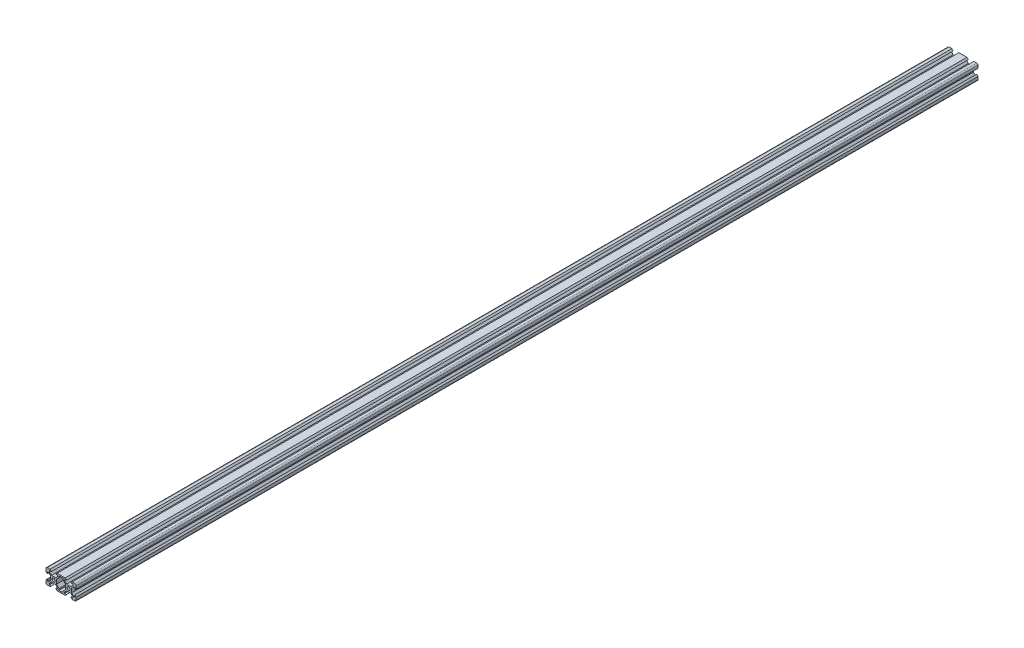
ISO-10303-21;
HEADER;
FILE_DESCRIPTION(('STEP AP214'),'2;1');
FILE_NAME('part.step','',(''),(''),'','','');
FILE_SCHEMA(('AUTOMOTIVE_DESIGN { 1 0 10303 214 1 1 1 1 }'));
ENDSEC;
DATA;
#1=APPLICATION_CONTEXT('core data for automotive mechanical design processes');
#2=APPLICATION_PROTOCOL_DEFINITION('international standard','automotive_design',2000,#1);
#3=PRODUCT_CONTEXT('',#1,'mechanical');
#4=PRODUCT('Part','Part','',(#3));
#5=PRODUCT_RELATED_PRODUCT_CATEGORY('part','',(#4));
#6=PRODUCT_DEFINITION_FORMATION('','',#4);
#7=PRODUCT_DEFINITION_CONTEXT('part definition',#1,'design');
#8=PRODUCT_DEFINITION('design','',#6,#7);
#9=PRODUCT_DEFINITION_SHAPE('','',#8);
#10=(LENGTH_UNIT() NAMED_UNIT(*) SI_UNIT(.MILLI.,.METRE.));
#11=(NAMED_UNIT(*) PLANE_ANGLE_UNIT() SI_UNIT($,.RADIAN.));
#12=(NAMED_UNIT(*) SI_UNIT($,.STERADIAN.) SOLID_ANGLE_UNIT());
#13=UNCERTAINTY_MEASURE_WITH_UNIT(LENGTH_MEASURE(1.E-05),#10,'distance_accuracy_value','');
#14=(GEOMETRIC_REPRESENTATION_CONTEXT(3) GLOBAL_UNCERTAINTY_ASSIGNED_CONTEXT((#13)) GLOBAL_UNIT_ASSIGNED_CONTEXT((#10,
#11,#12)) REPRESENTATION_CONTEXT('',''));
#15=CARTESIAN_POINT('',(0.,0.,0.));
#16=DIRECTION('',(0.,0.,1.));
#17=DIRECTION('',(1.,0.,0.));
#18=AXIS2_PLACEMENT_3D('',#15,#16,#17);
#19=CARTESIAN_POINT('',(2.69933982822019,-8.19999999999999,0.));
#20=DIRECTION('',(1.,0.,0.));
#21=DIRECTION('',(0.,0.707106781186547,0.707106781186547));
#22=AXIS2_PLACEMENT_3D('',#19,#20,#21);
#23=PLANE('',#22);
#24=DIRECTION('',(0.,0.,1.));
#25=VECTOR('',#24,1.);
#26=CARTESIAN_POINT('',(2.69933982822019,-8.19999999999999,0.));
#27=LINE('',#26,#25);
#28=CARTESIAN_POINT('',(2.69933982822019,-8.19999999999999,0.));
#29=VERTEX_POINT('',#28);
#30=CARTESIAN_POINT('',(2.69933982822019,-8.19999999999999,1193.8));
#31=VERTEX_POINT('',#30);
#32=EDGE_CURVE('E11',#29,#31,#27,.T.);
#33=ORIENTED_EDGE('',*,*,#32,.T.);
#34=DIRECTION('',(0.,1.,0.));
#35=VECTOR('',#34,1.);
#36=CARTESIAN_POINT('',(2.69933982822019,-8.19999999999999,1193.8));
#37=LINE('',#36,#35);
#38=CARTESIAN_POINT('',(2.69933982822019,-6.23999999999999,1193.8));
#39=VERTEX_POINT('',#38);
#40=EDGE_CURVE('E598',#31,#39,#37,.T.);
#41=ORIENTED_EDGE('',*,*,#40,.T.);
#42=DIRECTION('',(0.,0.,1.));
#43=VECTOR('',#42,1.);
#44=CARTESIAN_POINT('',(2.69933982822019,-6.23999999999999,0.));
#45=LINE('',#44,#43);
#46=CARTESIAN_POINT('',(2.69933982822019,-6.23999999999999,0.));
#47=VERTEX_POINT('',#46);
#48=EDGE_CURVE('E47',#47,#39,#45,.T.);
#49=ORIENTED_EDGE('',*,*,#48,.F.);
#50=DIRECTION('',(0.,1.,0.));
#51=VECTOR('',#50,1.);
#52=CARTESIAN_POINT('',(2.69933982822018,-4.09999999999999,0.));
#53=LINE('',#52,#51);
#54=EDGE_CURVE('E56',#29,#47,#53,.T.);
#55=ORIENTED_EDGE('',*,*,#54,.F.);
#56=EDGE_LOOP('',(#33,#41,#49,#55));
#57=FACE_BOUND('',#56,.T.);
#58=ADVANCED_FACE('F37',(#57),#23,.F.);
#59=CARTESIAN_POINT('',(2.69933982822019,-6.23999999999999,0.));
#60=DIRECTION('',(0.707106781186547,-0.707106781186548,0.));
#61=DIRECTION('',(0.577350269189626,0.577350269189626,0.577350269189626));
#62=AXIS2_PLACEMENT_3D('',#59,#60,#61);
#63=PLANE('',#62);
#64=ORIENTED_EDGE('',*,*,#48,.T.);
#65=DIRECTION('',(0.707106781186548,0.707106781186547,0.));
#66=VECTOR('',#65,1.);
#67=CARTESIAN_POINT('',(2.69933982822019,-6.23999999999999,1193.8));
#68=LINE('',#67,#66);
#69=CARTESIAN_POINT('',(6.09933982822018,-2.84,1193.8));
#70=VERTEX_POINT('',#69);
#71=EDGE_CURVE('E601',#39,#70,#68,.T.);
#72=ORIENTED_EDGE('',*,*,#71,.T.);
#73=DIRECTION('',(0.,0.,1.));
#74=VECTOR('',#73,1.);
#75=CARTESIAN_POINT('',(6.09933982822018,-2.84,0.));
#76=LINE('',#75,#74);
#77=CARTESIAN_POINT('',(6.09933982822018,-2.84,0.));
#78=VERTEX_POINT('',#77);
#79=EDGE_CURVE('E822',#78,#70,#76,.T.);
#80=ORIENTED_EDGE('',*,*,#79,.F.);
#81=DIRECTION('',(0.707106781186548,0.707106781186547,0.));
#82=VECTOR('',#81,1.);
#83=CARTESIAN_POINT('',(3.58450487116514,-5.35483495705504,0.));
#84=LINE('',#83,#82);
#85=EDGE_CURVE('E824',#47,#78,#84,.T.);
#86=ORIENTED_EDGE('',*,*,#85,.F.);
#87=EDGE_LOOP('',(#64,#72,#80,#86));
#88=FACE_BOUND('',#87,.T.);
#89=ADVANCED_FACE('F1473',(#88),#63,.F.);
#90=CARTESIAN_POINT('',(6.09933982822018,-2.84,0.));
#91=DIRECTION('',(1.,0.,0.));
#92=DIRECTION('',(0.,0.707106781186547,0.707106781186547));
#93=AXIS2_PLACEMENT_3D('',#90,#91,#92);
#94=PLANE('',#93);
#95=ORIENTED_EDGE('',*,*,#79,.T.);
#96=DIRECTION('',(0.,1.,0.));
#97=VECTOR('',#96,1.);
#98=CARTESIAN_POINT('',(6.09933982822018,-2.84,1193.8));
#99=LINE('',#98,#97);
#100=CARTESIAN_POINT('',(6.09933982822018,2.84000000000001,1193.8));
#101=VERTEX_POINT('',#100);
#102=EDGE_CURVE('E604',#70,#101,#99,.T.);
#103=ORIENTED_EDGE('',*,*,#102,.T.);
#104=DIRECTION('',(0.,0.,1.));
#105=VECTOR('',#104,1.);
#106=CARTESIAN_POINT('',(6.09933982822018,2.84000000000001,0.));
#107=LINE('',#106,#105);
#108=CARTESIAN_POINT('',(6.09933982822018,2.84000000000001,0.));
#109=VERTEX_POINT('',#108);
#110=EDGE_CURVE('E827',#109,#101,#107,.T.);
#111=ORIENTED_EDGE('',*,*,#110,.F.);
#112=DIRECTION('',(0.,1.,0.));
#113=VECTOR('',#112,1.);
#114=CARTESIAN_POINT('',(6.09933982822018,-1.42,0.));
#115=LINE('',#114,#113);
#116=EDGE_CURVE('E829',#78,#109,#115,.T.);
#117=ORIENTED_EDGE('',*,*,#116,.F.);
#118=EDGE_LOOP('',(#95,#103,#111,#117));
#119=FACE_BOUND('',#118,.T.);
#120=ADVANCED_FACE('F1479',(#119),#94,.F.);
#121=CARTESIAN_POINT('',(6.09933982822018,2.84000000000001,0.));
#122=DIRECTION('',(0.707106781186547,0.707106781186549,0.));
#123=DIRECTION('',(-0.577350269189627,0.577350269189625,0.577350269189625));
#124=AXIS2_PLACEMENT_3D('',#121,#122,#123);
#125=PLANE('',#124);
#126=ORIENTED_EDGE('',*,*,#110,.T.);
#127=DIRECTION('',(-0.707106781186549,0.707106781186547,0.));
#128=VECTOR('',#127,1.);
#129=CARTESIAN_POINT('',(6.09933982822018,2.84000000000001,1193.8));
#130=LINE('',#129,#128);
#131=CARTESIAN_POINT('',(2.69933982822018,6.23999999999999,1193.8));
#132=VERTEX_POINT('',#131);
#133=EDGE_CURVE('E607',#101,#132,#130,.T.);
#134=ORIENTED_EDGE('',*,*,#133,.T.);
#135=DIRECTION('',(0.,0.,1.));
#136=VECTOR('',#135,1.);
#137=CARTESIAN_POINT('',(2.69933982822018,6.23999999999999,0.));
#138=LINE('',#137,#136);
#139=CARTESIAN_POINT('',(2.69933982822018,6.23999999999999,0.));
#140=VERTEX_POINT('',#139);
#141=EDGE_CURVE('E312',#140,#132,#138,.T.);
#142=ORIENTED_EDGE('',*,*,#141,.F.);
#143=DIRECTION('',(-0.707106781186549,0.707106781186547,0.));
#144=VECTOR('',#143,1.);
#145=CARTESIAN_POINT('',(5.28450487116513,3.65483495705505,0.));
#146=LINE('',#145,#144);
#147=EDGE_CURVE('E832',#109,#140,#146,.T.);
#148=ORIENTED_EDGE('',*,*,#147,.F.);
#149=EDGE_LOOP('',(#126,#134,#142,#148));
#150=FACE_BOUND('',#149,.T.);
#151=ADVANCED_FACE('F1486',(#150),#125,.F.);
#152=CARTESIAN_POINT('',(2.69933982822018,6.23999999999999,0.));
#153=DIRECTION('',(1.,0.,0.));
#154=DIRECTION('',(0.,0.707106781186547,0.707106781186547));
#155=AXIS2_PLACEMENT_3D('',#152,#153,#154);
#156=PLANE('',#155);
#157=ORIENTED_EDGE('',*,*,#141,.T.);
#158=DIRECTION('',(0.,1.,0.));
#159=VECTOR('',#158,1.);
#160=CARTESIAN_POINT('',(2.69933982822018,6.23999999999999,1193.8));
#161=LINE('',#160,#159);
#162=CARTESIAN_POINT('',(2.69933982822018,8.2,1193.8));
#163=VERTEX_POINT('',#162);
#164=EDGE_CURVE('E609',#132,#163,#161,.T.);
#165=ORIENTED_EDGE('',*,*,#164,.T.);
#166=DIRECTION('',(0.,0.,1.));
#167=VECTOR('',#166,1.);
#168=CARTESIAN_POINT('',(2.69933982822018,8.2,0.));
#169=LINE('',#168,#167);
#170=CARTESIAN_POINT('',(2.69933982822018,8.2,0.));
#171=VERTEX_POINT('',#170);
#172=EDGE_CURVE('E575',#171,#163,#169,.T.);
#173=ORIENTED_EDGE('',*,*,#172,.F.);
#174=DIRECTION('',(0.,1.,0.));
#175=VECTOR('',#174,1.);
#176=CARTESIAN_POINT('',(2.69933982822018,3.12,0.));
#177=LINE('',#176,#175);
#178=EDGE_CURVE('E835',#140,#171,#177,.T.);
#179=ORIENTED_EDGE('',*,*,#178,.F.);
#180=EDGE_LOOP('',(#157,#165,#173,#179));
#181=FACE_BOUND('',#180,.T.);
#182=ADVANCED_FACE('F1490',(#181),#156,.F.);
#183=CARTESIAN_POINT('',(2.69933982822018,8.2,0.));
#184=DIRECTION('',(0.,1.,0.));
#185=DIRECTION('',(0.707106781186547,0.,0.707106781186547));
#186=AXIS2_PLACEMENT_3D('',#183,#184,#185);
#187=PLANE('',#186);
#188=ORIENTED_EDGE('',*,*,#172,.T.);
#189=DIRECTION('',(-1.,0.,0.));
#190=VECTOR('',#189,1.);
#191=CARTESIAN_POINT('',(2.69933982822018,8.2,1193.8));
#192=LINE('',#191,#190);
#193=CARTESIAN_POINT('',(-2.69933982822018,8.2,1193.8));
#194=VERTEX_POINT('',#193);
#195=EDGE_CURVE('E572',#163,#194,#192,.T.);
#196=ORIENTED_EDGE('',*,*,#195,.T.);
#197=DIRECTION('',(0.,0.,1.));
#198=VECTOR('',#197,1.);
#199=CARTESIAN_POINT('',(-2.69933982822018,8.2,0.));
#200=LINE('',#199,#198);
#201=CARTESIAN_POINT('',(-2.69933982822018,8.2,0.));
#202=VERTEX_POINT('',#201);
#203=EDGE_CURVE('E558',#202,#194,#200,.T.);
#204=ORIENTED_EDGE('',*,*,#203,.F.);
#205=DIRECTION('',(-1.,0.,0.));
#206=VECTOR('',#205,1.);
#207=CARTESIAN_POINT('',(1.34966991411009,8.2,0.));
#208=LINE('',#207,#206);
#209=EDGE_CURVE('E838',#171,#202,#208,.T.);
#210=ORIENTED_EDGE('',*,*,#209,.F.);
#211=EDGE_LOOP('',(#188,#196,#204,#210));
#212=FACE_BOUND('',#211,.T.);
#213=ADVANCED_FACE('F573',(#212),#187,.F.);
#214=CARTESIAN_POINT('',(15.4993398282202,8.20000000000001,0.));
#215=DIRECTION('',(-1.,0.,0.));
#216=DIRECTION('',(0.,0.707106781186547,0.707106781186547));
#217=AXIS2_PLACEMENT_3D('',#214,#215,#216);
#218=PLANE('',#217);
#219=DIRECTION('',(0.,0.,1.));
#220=VECTOR('',#219,1.);
#221=CARTESIAN_POINT('',(15.4993398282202,6.56000000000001,0.));
#222=LINE('',#221,#220);
#223=CARTESIAN_POINT('',(15.4993398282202,6.56000000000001,0.));
#224=VERTEX_POINT('',#223);
#225=CARTESIAN_POINT('',(15.4993398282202,6.56000000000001,1193.8));
#226=VERTEX_POINT('',#225);
#227=EDGE_CURVE('E837',#224,#226,#222,.T.);
#228=ORIENTED_EDGE('',*,*,#227,.T.);
#229=DIRECTION('',(0.,-1.,0.));
#230=VECTOR('',#229,1.);
#231=CARTESIAN_POINT('',(15.4993398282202,8.20000000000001,1193.8));
#232=LINE('',#231,#230);
#233=CARTESIAN_POINT('',(15.4993398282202,8.20000000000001,1193.8));
#234=VERTEX_POINT('',#233);
#235=EDGE_CURVE('E722',#234,#226,#232,.T.);
#236=ORIENTED_EDGE('',*,*,#235,.F.);
#237=DIRECTION('',(0.,0.,1.));
#238=VECTOR('',#237,1.);
#239=CARTESIAN_POINT('',(15.4993398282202,8.20000000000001,0.));
#240=LINE('',#239,#238);
#241=CARTESIAN_POINT('',(15.4993398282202,8.20000000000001,0.));
#242=VERTEX_POINT('',#241);
#243=EDGE_CURVE('E842',#242,#234,#240,.T.);
#244=ORIENTED_EDGE('',*,*,#243,.F.);
#245=DIRECTION('',(0.,1.,0.));
#246=VECTOR('',#245,1.);
#247=CARTESIAN_POINT('',(15.4993398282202,4.09999999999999,0.));
#248=LINE('',#247,#246);
#249=EDGE_CURVE('E845',#224,#242,#248,.T.);
#250=ORIENTED_EDGE('',*,*,#249,.F.);
#251=EDGE_LOOP('',(#228,#236,#244,#250));
#252=FACE_BOUND('',#251,.T.);
#253=ADVANCED_FACE('F1140',(#252),#218,.T.);
#254=CARTESIAN_POINT('',(12.84,8.2,0.));
#255=DIRECTION('',(0.,-1.,0.));
#256=DIRECTION('',(0.707106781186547,0.,0.707106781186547));
#257=AXIS2_PLACEMENT_3D('',#254,#255,#256);
#258=PLANE('',#257);
#259=ORIENTED_EDGE('',*,*,#243,.T.);
#260=DIRECTION('',(1.,0.,0.));
#261=VECTOR('',#260,1.);
#262=CARTESIAN_POINT('',(12.84,8.2,1193.8));
#263=LINE('',#262,#261);
#264=CARTESIAN_POINT('',(12.84,8.2,1193.8));
#265=VERTEX_POINT('',#264);
#266=EDGE_CURVE('E719',#265,#234,#263,.T.);
#267=ORIENTED_EDGE('',*,*,#266,.F.);
#268=DIRECTION('',(0.,0.,1.));
#269=VECTOR('',#268,1.);
#270=CARTESIAN_POINT('',(12.84,8.2,0.));
#271=LINE('',#270,#269);
#272=CARTESIAN_POINT('',(12.84,8.2,0.));
#273=VERTEX_POINT('',#272);
#274=EDGE_CURVE('E844',#273,#265,#271,.T.);
#275=ORIENTED_EDGE('',*,*,#274,.F.);
#276=DIRECTION('',(-1.,0.,0.));
#277=VECTOR('',#276,1.);
#278=CARTESIAN_POINT('',(6.41999999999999,8.19999999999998,0.));
#279=LINE('',#278,#277);
#280=EDGE_CURVE('E847',#242,#273,#279,.T.);
#281=ORIENTED_EDGE('',*,*,#280,.F.);
#282=EDGE_LOOP('',(#259,#267,#275,#281));
#283=FACE_BOUND('',#282,.T.);
#284=ADVANCED_FACE('F1148',(#283),#258,.T.);
#285=CARTESIAN_POINT('',(14.64,10.,0.));
#286=DIRECTION('',(-0.707106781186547,0.707106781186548,0.));
#287=DIRECTION('',(0.577350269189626,0.577350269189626,0.577350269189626));
#288=AXIS2_PLACEMENT_3D('',#285,#286,#287);
#289=PLANE('',#288);
#290=ORIENTED_EDGE('',*,*,#274,.T.);
#291=DIRECTION('',(-0.707106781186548,-0.707106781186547,0.));
#292=VECTOR('',#291,1.);
#293=CARTESIAN_POINT('',(14.64,10.,1193.8));
#294=LINE('',#293,#292);
#295=CARTESIAN_POINT('',(14.64,10.,1193.8));
#296=VERTEX_POINT('',#295);
#297=EDGE_CURVE('E716',#296,#265,#294,.T.);
#298=ORIENTED_EDGE('',*,*,#297,.F.);
#299=DIRECTION('',(0.,0.,1.));
#300=VECTOR('',#299,1.);
#301=CARTESIAN_POINT('',(14.64,10.,0.));
#302=LINE('',#301,#300);
#303=CARTESIAN_POINT('',(14.64,10.,0.));
#304=VERTEX_POINT('',#303);
#305=EDGE_CURVE('E850',#304,#296,#302,.T.);
#306=ORIENTED_EDGE('',*,*,#305,.F.);
#307=DIRECTION('',(0.707106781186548,0.707106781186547,0.));
#308=VECTOR('',#307,1.);
#309=CARTESIAN_POINT('',(8.48,3.84,0.));
#310=LINE('',#309,#308);
#311=EDGE_CURVE('E852',#273,#304,#310,.T.);
#312=ORIENTED_EDGE('',*,*,#311,.F.);
#313=EDGE_LOOP('',(#290,#298,#306,#312));
#314=FACE_BOUND('',#313,.T.);
#315=ADVANCED_FACE('F1155',(#314),#289,.T.);
#316=CARTESIAN_POINT('',(18.2,10.,0.));
#317=DIRECTION('',(0.,1.,0.));
#318=DIRECTION('',(0.707106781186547,0.,0.707106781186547));
#319=AXIS2_PLACEMENT_3D('',#316,#317,#318);
#320=PLANE('',#319);
#321=ORIENTED_EDGE('',*,*,#305,.T.);
#322=DIRECTION('',(-1.,0.,0.));
#323=VECTOR('',#322,1.);
#324=CARTESIAN_POINT('',(18.2,10.,1193.8));
#325=LINE('',#324,#323);
#326=CARTESIAN_POINT('',(18.2,10.,1193.8));
#327=VERTEX_POINT('',#326);
#328=EDGE_CURVE('E713',#327,#296,#325,.T.);
#329=ORIENTED_EDGE('',*,*,#328,.F.);
#330=DIRECTION('',(0.,0.,1.));
#331=VECTOR('',#330,1.);
#332=CARTESIAN_POINT('',(18.2,10.,0.));
#333=LINE('',#332,#331);
#334=CARTESIAN_POINT('',(18.2,10.,0.));
#335=VERTEX_POINT('',#334);
#336=EDGE_CURVE('E854',#335,#327,#333,.T.);
#337=ORIENTED_EDGE('',*,*,#336,.F.);
#338=DIRECTION('',(1.,0.,0.));
#339=VECTOR('',#338,1.);
#340=CARTESIAN_POINT('',(9.09999999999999,9.99999999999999,0.));
#341=LINE('',#340,#339);
#342=EDGE_CURVE('E856',#304,#335,#341,.T.);
#343=ORIENTED_EDGE('',*,*,#342,.F.);
#344=EDGE_LOOP('',(#321,#329,#337,#343));
#345=FACE_BOUND('',#344,.T.);
#346=ADVANCED_FACE('F1158',(#345),#320,.T.);
#347=CARTESIAN_POINT('',(18.2,8.2,0.));
#348=DIRECTION('',(0.,0.,1.));
#349=DIRECTION('',(-1.,0.,0.));
#350=AXIS2_PLACEMENT_3D('',#347,#348,#349);
#351=CYLINDRICAL_SURFACE('',#350,1.8);
#352=ORIENTED_EDGE('',*,*,#336,.T.);
#353=CARTESIAN_POINT('',(18.2,8.2,1193.8));
#354=DIRECTION('',(0.,0.,1.));
#355=DIRECTION('',(1.,0.,0.));
#356=AXIS2_PLACEMENT_3D('',#353,#354,#355);
#357=CIRCLE('',#356,1.8);
#358=CARTESIAN_POINT('',(20.,8.2,1193.8));
#359=VERTEX_POINT('',#358);
#360=EDGE_CURVE('E710',#359,#327,#357,.T.);
#361=ORIENTED_EDGE('',*,*,#360,.F.);
#362=DIRECTION('',(0.,0.,1.));
#363=VECTOR('',#362,1.);
#364=CARTESIAN_POINT('',(20.,8.2,0.));
#365=LINE('',#364,#363);
#366=CARTESIAN_POINT('',(20.,8.2,0.));
#367=VERTEX_POINT('',#366);
#368=EDGE_CURVE('E858',#367,#359,#365,.T.);
#369=ORIENTED_EDGE('',*,*,#368,.F.);
#370=CARTESIAN_POINT('',(18.2,8.2,0.));
#371=DIRECTION('',(0.,0.,-1.));
#372=DIRECTION('',(-1.,0.,0.));
#373=AXIS2_PLACEMENT_3D('',#370,#371,#372);
#374=CIRCLE('',#373,1.8);
#375=EDGE_CURVE('E860',#335,#367,#374,.T.);
#376=ORIENTED_EDGE('',*,*,#375,.F.);
#377=EDGE_LOOP('',(#352,#361,#369,#376));
#378=FACE_BOUND('',#377,.T.);
#379=ADVANCED_FACE('F1163',(#378),#351,.T.);
#380=CARTESIAN_POINT('',(20.,4.64,0.));
#381=DIRECTION('',(1.,0.,0.));
#382=DIRECTION('',(0.,0.707106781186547,0.707106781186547));
#383=AXIS2_PLACEMENT_3D('',#380,#381,#382);
#384=PLANE('',#383);
#385=ORIENTED_EDGE('',*,*,#368,.T.);
#386=DIRECTION('',(0.,1.,0.));
#387=VECTOR('',#386,1.);
#388=CARTESIAN_POINT('',(20.,4.64,1193.8));
#389=LINE('',#388,#387);
#390=CARTESIAN_POINT('',(20.,4.64,1193.8));
#391=VERTEX_POINT('',#390);
#392=EDGE_CURVE('E707',#391,#359,#389,.T.);
#393=ORIENTED_EDGE('',*,*,#392,.F.);
#394=DIRECTION('',(0.,0.,1.));
#395=VECTOR('',#394,1.);
#396=CARTESIAN_POINT('',(20.,4.64,0.));
#397=LINE('',#396,#395);
#398=CARTESIAN_POINT('',(20.,4.64,0.));
#399=VERTEX_POINT('',#398);
#400=EDGE_CURVE('E862',#399,#391,#397,.T.);
#401=ORIENTED_EDGE('',*,*,#400,.F.);
#402=DIRECTION('',(0.,-1.,0.));
#403=VECTOR('',#402,1.);
#404=CARTESIAN_POINT('',(20.,2.31999999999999,0.));
#405=LINE('',#404,#403);
#406=EDGE_CURVE('E864',#367,#399,#405,.T.);
#407=ORIENTED_EDGE('',*,*,#406,.F.);
#408=EDGE_LOOP('',(#385,#393,#401,#407));
#409=FACE_BOUND('',#408,.T.);
#410=ADVANCED_FACE('F1170',(#409),#384,.T.);
#411=CARTESIAN_POINT('',(18.2,2.84,0.));
#412=DIRECTION('',(0.707106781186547,-0.707106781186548,0.));
#413=DIRECTION('',(0.577350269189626,0.577350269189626,0.577350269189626));
#414=AXIS2_PLACEMENT_3D('',#411,#412,#413);
#415=PLANE('',#414);
#416=ORIENTED_EDGE('',*,*,#400,.T.);
#417=DIRECTION('',(0.707106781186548,0.707106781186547,0.));
#418=VECTOR('',#417,1.);
#419=CARTESIAN_POINT('',(18.2,2.84,1193.8));
#420=LINE('',#419,#418);
#421=CARTESIAN_POINT('',(18.2,2.84,1193.8));
#422=VERTEX_POINT('',#421);
#423=EDGE_CURVE('E704',#422,#391,#420,.T.);
#424=ORIENTED_EDGE('',*,*,#423,.F.);
#425=DIRECTION('',(0.,0.,1.));
#426=VECTOR('',#425,1.);
#427=CARTESIAN_POINT('',(18.2,2.84,0.));
#428=LINE('',#427,#426);
#429=CARTESIAN_POINT('',(18.2,2.84,0.));
#430=VERTEX_POINT('',#429);
#431=EDGE_CURVE('E866',#430,#422,#428,.T.);
#432=ORIENTED_EDGE('',*,*,#431,.F.);
#433=DIRECTION('',(-0.707106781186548,-0.707106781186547,0.));
#434=VECTOR('',#433,1.);
#435=CARTESIAN_POINT('',(12.94,-2.42,0.));
#436=LINE('',#435,#434);
#437=EDGE_CURVE('E868',#399,#430,#436,.T.);
#438=ORIENTED_EDGE('',*,*,#437,.F.);
#439=EDGE_LOOP('',(#416,#424,#432,#438));
#440=FACE_BOUND('',#439,.T.);
#441=ADVANCED_FACE('F1173',(#440),#415,.T.);
#442=CARTESIAN_POINT('',(18.2,5.49933982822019,0.));
#443=DIRECTION('',(-1.,0.,0.));
#444=DIRECTION('',(0.,0.707106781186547,0.707106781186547));
#445=AXIS2_PLACEMENT_3D('',#442,#443,#444);
#446=PLANE('',#445);
#447=ORIENTED_EDGE('',*,*,#431,.T.);
#448=DIRECTION('',(0.,-1.,0.));
#449=VECTOR('',#448,1.);
#450=CARTESIAN_POINT('',(18.2,5.49933982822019,1193.8));
#451=LINE('',#450,#449);
#452=CARTESIAN_POINT('',(18.2,5.49933982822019,1193.8));
#453=VERTEX_POINT('',#452);
#454=EDGE_CURVE('E701',#453,#422,#451,.T.);
#455=ORIENTED_EDGE('',*,*,#454,.F.);
#456=DIRECTION('',(0.,0.,1.));
#457=VECTOR('',#456,1.);
#458=CARTESIAN_POINT('',(18.2,5.49933982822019,0.));
#459=LINE('',#458,#457);
#460=CARTESIAN_POINT('',(18.2,5.49933982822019,0.));
#461=VERTEX_POINT('',#460);
#462=EDGE_CURVE('E870',#461,#453,#459,.T.);
#463=ORIENTED_EDGE('',*,*,#462,.F.);
#464=DIRECTION('',(0.,1.,0.));
#465=VECTOR('',#464,1.);
#466=CARTESIAN_POINT('',(18.2,2.74966991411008,0.));
#467=LINE('',#466,#465);
#468=EDGE_CURVE('E872',#430,#461,#467,.T.);
#469=ORIENTED_EDGE('',*,*,#468,.F.);
#470=EDGE_LOOP('',(#447,#455,#463,#469));
#471=FACE_BOUND('',#470,.T.);
#472=ADVANCED_FACE('F1178',(#471),#446,.T.);
#473=CARTESIAN_POINT('',(16.56,5.49933982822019,0.));
#474=DIRECTION('',(0.,-1.,0.));
#475=DIRECTION('',(0.707106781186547,0.,0.707106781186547));
#476=AXIS2_PLACEMENT_3D('',#473,#474,#475);
#477=PLANE('',#476);
#478=ORIENTED_EDGE('',*,*,#462,.T.);
#479=DIRECTION('',(1.,0.,0.));
#480=VECTOR('',#479,1.);
#481=CARTESIAN_POINT('',(16.56,5.49933982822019,1193.8));
#482=LINE('',#481,#480);
#483=CARTESIAN_POINT('',(16.56,5.49933982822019,1193.8));
#484=VERTEX_POINT('',#483);
#485=EDGE_CURVE('E698',#484,#453,#482,.T.);
#486=ORIENTED_EDGE('',*,*,#485,.F.);
#487=DIRECTION('',(0.,0.,1.));
#488=VECTOR('',#487,1.);
#489=CARTESIAN_POINT('',(16.56,5.49933982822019,0.));
#490=LINE('',#489,#488);
#491=CARTESIAN_POINT('',(16.56,5.49933982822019,0.));
#492=VERTEX_POINT('',#491);
#493=EDGE_CURVE('E874',#492,#484,#490,.T.);
#494=ORIENTED_EDGE('',*,*,#493,.F.);
#495=DIRECTION('',(-1.,0.,0.));
#496=VECTOR('',#495,1.);
#497=CARTESIAN_POINT('',(8.28,5.49933982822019,0.));
#498=LINE('',#497,#496);
#499=EDGE_CURVE('E876',#461,#492,#498,.T.);
#500=ORIENTED_EDGE('',*,*,#499,.F.);
#501=EDGE_LOOP('',(#478,#486,#494,#500));
#502=FACE_BOUND('',#501,.T.);
#503=ADVANCED_FACE('F1185',(#502),#477,.T.);
#504=CARTESIAN_POINT('',(13.9006601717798,2.84,0.));
#505=DIRECTION('',(0.707106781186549,-0.707106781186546,0.));
#506=DIRECTION('',(0.577350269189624,0.577350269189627,0.577350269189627));
#507=AXIS2_PLACEMENT_3D('',#504,#505,#506);
#508=PLANE('',#507);
#509=ORIENTED_EDGE('',*,*,#493,.T.);
#510=DIRECTION('',(0.707106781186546,0.707106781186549,0.));
#511=VECTOR('',#510,1.);
#512=CARTESIAN_POINT('',(13.9006601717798,2.84,1193.8));
#513=LINE('',#512,#511);
#514=CARTESIAN_POINT('',(13.9006601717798,2.84,1193.8));
#515=VERTEX_POINT('',#514);
#516=EDGE_CURVE('E695',#515,#484,#513,.T.);
#517=ORIENTED_EDGE('',*,*,#516,.F.);
#518=DIRECTION('',(0.,0.,1.));
#519=VECTOR('',#518,1.);
#520=CARTESIAN_POINT('',(13.9006601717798,2.84,0.));
#521=LINE('',#520,#519);
#522=CARTESIAN_POINT('',(13.9006601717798,2.84,0.));
#523=VERTEX_POINT('',#522);
#524=EDGE_CURVE('E878',#523,#515,#521,.T.);
#525=ORIENTED_EDGE('',*,*,#524,.F.);
#526=DIRECTION('',(-0.707106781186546,-0.707106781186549,0.));
#527=VECTOR('',#526,1.);
#528=CARTESIAN_POINT('',(9.71549512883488,-1.34516504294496,0.));
#529=LINE('',#528,#527);
#530=EDGE_CURVE('E880',#492,#523,#529,.T.);
#531=ORIENTED_EDGE('',*,*,#530,.F.);
#532=EDGE_LOOP('',(#509,#517,#525,#531));
#533=FACE_BOUND('',#532,.T.);
#534=ADVANCED_FACE('F1188',(#533),#508,.T.);
#535=CARTESIAN_POINT('',(13.9006601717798,-2.84,0.));
#536=DIRECTION('',(1.,0.,0.));
#537=DIRECTION('',(0.,0.707106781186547,0.707106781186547));
#538=AXIS2_PLACEMENT_3D('',#535,#536,#537);
#539=PLANE('',#538);
#540=ORIENTED_EDGE('',*,*,#524,.T.);
#541=DIRECTION('',(0.,1.,0.));
#542=VECTOR('',#541,1.);
#543=CARTESIAN_POINT('',(13.9006601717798,-2.84,1193.8));
#544=LINE('',#543,#542);
#545=CARTESIAN_POINT('',(13.9006601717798,-2.84,1193.8));
#546=VERTEX_POINT('',#545);
#547=EDGE_CURVE('E692',#546,#515,#544,.T.);
#548=ORIENTED_EDGE('',*,*,#547,.F.);
#549=DIRECTION('',(0.,0.,1.));
#550=VECTOR('',#549,1.);
#551=CARTESIAN_POINT('',(13.9006601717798,-2.84,0.));
#552=LINE('',#551,#550);
#553=CARTESIAN_POINT('',(13.9006601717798,-2.84,0.));
#554=VERTEX_POINT('',#553);
#555=EDGE_CURVE('E882',#554,#546,#552,.T.);
#556=ORIENTED_EDGE('',*,*,#555,.F.);
#557=DIRECTION('',(0.,-1.,0.));
#558=VECTOR('',#557,1.);
#559=CARTESIAN_POINT('',(13.9006601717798,-1.42,0.));
#560=LINE('',#559,#558);
#561=EDGE_CURVE('E884',#523,#554,#560,.T.);
#562=ORIENTED_EDGE('',*,*,#561,.F.);
#563=EDGE_LOOP('',(#540,#548,#556,#562));
#564=FACE_BOUND('',#563,.T.);
#565=ADVANCED_FACE('F1193',(#564),#539,.T.);
#566=CARTESIAN_POINT('',(16.56,-5.49933982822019,0.));
#567=DIRECTION('',(0.707106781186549,0.707106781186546,0.));
#568=DIRECTION('',(-0.577350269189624,0.577350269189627,0.577350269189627));
#569=AXIS2_PLACEMENT_3D('',#566,#567,#568);
#570=PLANE('',#569);
#571=ORIENTED_EDGE('',*,*,#555,.T.);
#572=DIRECTION('',(-0.707106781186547,0.707106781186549,0.));
#573=VECTOR('',#572,1.);
#574=CARTESIAN_POINT('',(16.56,-5.49933982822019,1193.8));
#575=LINE('',#574,#573);
#576=CARTESIAN_POINT('',(16.56,-5.49933982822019,1193.8));
#577=VERTEX_POINT('',#576);
#578=EDGE_CURVE('E689',#577,#546,#575,.T.);
#579=ORIENTED_EDGE('',*,*,#578,.F.);
#580=DIRECTION('',(0.,0.,1.));
#581=VECTOR('',#580,1.);
#582=CARTESIAN_POINT('',(16.56,-5.49933982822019,0.));
#583=LINE('',#582,#581);
#584=CARTESIAN_POINT('',(16.56,-5.49933982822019,0.));
#585=VERTEX_POINT('',#584);
#586=EDGE_CURVE('E886',#585,#577,#583,.T.);
#587=ORIENTED_EDGE('',*,*,#586,.F.);
#588=DIRECTION('',(0.707106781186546,-0.707106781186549,0.));
#589=VECTOR('',#588,1.);
#590=CARTESIAN_POINT('',(11.045165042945,0.0154951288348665,0.));
#591=LINE('',#590,#589);
#592=EDGE_CURVE('E888',#554,#585,#591,.T.);
#593=ORIENTED_EDGE('',*,*,#592,.F.);
#594=EDGE_LOOP('',(#571,#579,#587,#593));
#595=FACE_BOUND('',#594,.T.);
#596=ADVANCED_FACE('F1200',(#595),#570,.T.);
#597=CARTESIAN_POINT('',(18.2,-5.49933982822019,0.));
#598=DIRECTION('',(0.,1.,0.));
#599=DIRECTION('',(0.707106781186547,0.,0.707106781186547));
#600=AXIS2_PLACEMENT_3D('',#597,#598,#599);
#601=PLANE('',#600);
#602=ORIENTED_EDGE('',*,*,#586,.T.);
#603=DIRECTION('',(-1.,0.,0.));
#604=VECTOR('',#603,1.);
#605=CARTESIAN_POINT('',(18.2,-5.49933982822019,1193.8));
#606=LINE('',#605,#604);
#607=CARTESIAN_POINT('',(18.2,-5.49933982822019,1193.8));
#608=VERTEX_POINT('',#607);
#609=EDGE_CURVE('E686',#608,#577,#606,.T.);
#610=ORIENTED_EDGE('',*,*,#609,.F.);
#611=DIRECTION('',(0.,0.,1.));
#612=VECTOR('',#611,1.);
#613=CARTESIAN_POINT('',(18.2,-5.49933982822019,0.));
#614=LINE('',#613,#612);
#615=CARTESIAN_POINT('',(18.2,-5.49933982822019,0.));
#616=VERTEX_POINT('',#615);
#617=EDGE_CURVE('E890',#616,#608,#614,.T.);
#618=ORIENTED_EDGE('',*,*,#617,.F.);
#619=DIRECTION('',(1.,0.,0.));
#620=VECTOR('',#619,1.);
#621=CARTESIAN_POINT('',(9.1,-5.49933982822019,0.));
#622=LINE('',#621,#620);
#623=EDGE_CURVE('E892',#585,#616,#622,.T.);
#624=ORIENTED_EDGE('',*,*,#623,.F.);
#625=EDGE_LOOP('',(#602,#610,#618,#624));
#626=FACE_BOUND('',#625,.T.);
#627=ADVANCED_FACE('F1203',(#626),#601,.T.);
#628=CARTESIAN_POINT('',(18.2,-2.84,0.));
#629=DIRECTION('',(-1.,0.,0.));
#630=DIRECTION('',(0.,0.707106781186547,0.707106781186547));
#631=AXIS2_PLACEMENT_3D('',#628,#629,#630);
#632=PLANE('',#631);
#633=ORIENTED_EDGE('',*,*,#617,.T.);
#634=DIRECTION('',(0.,-1.,0.));
#635=VECTOR('',#634,1.);
#636=CARTESIAN_POINT('',(18.2,-2.84,1193.8));
#637=LINE('',#636,#635);
#638=CARTESIAN_POINT('',(18.2,-2.84,1193.8));
#639=VERTEX_POINT('',#638);
#640=EDGE_CURVE('E683',#639,#608,#637,.T.);
#641=ORIENTED_EDGE('',*,*,#640,.F.);
#642=DIRECTION('',(0.,0.,1.));
#643=VECTOR('',#642,1.);
#644=CARTESIAN_POINT('',(18.2,-2.84,0.));
#645=LINE('',#644,#643);
#646=CARTESIAN_POINT('',(18.2,-2.84,0.));
#647=VERTEX_POINT('',#646);
#648=EDGE_CURVE('E894',#647,#639,#645,.T.);
#649=ORIENTED_EDGE('',*,*,#648,.F.);
#650=DIRECTION('',(0.,1.,0.));
#651=VECTOR('',#650,1.);
#652=CARTESIAN_POINT('',(18.2,-1.41999999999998,0.));
#653=LINE('',#652,#651);
#654=EDGE_CURVE('E896',#616,#647,#653,.T.);
#655=ORIENTED_EDGE('',*,*,#654,.F.);
#656=EDGE_LOOP('',(#633,#641,#649,#655));
#657=FACE_BOUND('',#656,.T.);
#658=ADVANCED_FACE('F1208',(#657),#632,.T.);
#659=CARTESIAN_POINT('',(20.,-4.64,0.));
#660=DIRECTION('',(0.707106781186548,0.707106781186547,0.));
#661=DIRECTION('',(-0.577350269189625,0.577350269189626,0.577350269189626));
#662=AXIS2_PLACEMENT_3D('',#659,#660,#661);
#663=PLANE('',#662);
#664=ORIENTED_EDGE('',*,*,#648,.T.);
#665=DIRECTION('',(-0.707106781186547,0.707106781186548,0.));
#666=VECTOR('',#665,1.);
#667=CARTESIAN_POINT('',(20.,-4.64,1193.8));
#668=LINE('',#667,#666);
#669=CARTESIAN_POINT('',(20.,-4.64,1193.8));
#670=VERTEX_POINT('',#669);
#671=EDGE_CURVE('E680',#670,#639,#668,.T.);
#672=ORIENTED_EDGE('',*,*,#671,.F.);
#673=DIRECTION('',(0.,0.,1.));
#674=VECTOR('',#673,1.);
#675=CARTESIAN_POINT('',(20.,-4.64,0.));
#676=LINE('',#675,#674);
#677=CARTESIAN_POINT('',(20.,-4.64,0.));
#678=VERTEX_POINT('',#677);
#679=EDGE_CURVE('E898',#678,#670,#676,.T.);
#680=ORIENTED_EDGE('',*,*,#679,.F.);
#681=DIRECTION('',(0.707106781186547,-0.707106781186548,0.));
#682=VECTOR('',#681,1.);
#683=CARTESIAN_POINT('',(13.84,1.52,0.));
#684=LINE('',#683,#682);
#685=EDGE_CURVE('E900',#647,#678,#684,.T.);
#686=ORIENTED_EDGE('',*,*,#685,.F.);
#687=EDGE_LOOP('',(#664,#672,#680,#686));
#688=FACE_BOUND('',#687,.T.);
#689=ADVANCED_FACE('F1215',(#688),#663,.T.);
#690=CARTESIAN_POINT('',(20.,-8.2,0.));
#691=DIRECTION('',(1.,0.,0.));
#692=DIRECTION('',(0.,0.707106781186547,0.707106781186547));
#693=AXIS2_PLACEMENT_3D('',#690,#691,#692);
#694=PLANE('',#693);
#695=ORIENTED_EDGE('',*,*,#679,.T.);
#696=DIRECTION('',(0.,1.,0.));
#697=VECTOR('',#696,1.);
#698=CARTESIAN_POINT('',(20.,-8.2,1193.8));
#699=LINE('',#698,#697);
#700=CARTESIAN_POINT('',(20.,-8.2,1193.8));
#701=VERTEX_POINT('',#700);
#702=EDGE_CURVE('E677',#701,#670,#699,.T.);
#703=ORIENTED_EDGE('',*,*,#702,.F.);
#704=DIRECTION('',(0.,0.,1.));
#705=VECTOR('',#704,1.);
#706=CARTESIAN_POINT('',(20.,-8.2,0.));
#707=LINE('',#706,#705);
#708=CARTESIAN_POINT('',(20.,-8.2,0.));
#709=VERTEX_POINT('',#708);
#710=EDGE_CURVE('E902',#709,#701,#707,.T.);
#711=ORIENTED_EDGE('',*,*,#710,.F.);
#712=DIRECTION('',(0.,-1.,0.));
#713=VECTOR('',#712,1.);
#714=CARTESIAN_POINT('',(20.,-4.09999999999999,0.));
#715=LINE('',#714,#713);
#716=EDGE_CURVE('E904',#678,#709,#715,.T.);
#717=ORIENTED_EDGE('',*,*,#716,.F.);
#718=EDGE_LOOP('',(#695,#703,#711,#717));
#719=FACE_BOUND('',#718,.T.);
#720=ADVANCED_FACE('F1218',(#719),#694,.T.);
#721=CARTESIAN_POINT('',(18.2,-8.20000000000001,0.));
#722=DIRECTION('',(0.,0.,1.));
#723=DIRECTION('',(0.,1.,0.));
#724=AXIS2_PLACEMENT_3D('',#721,#722,#723);
#725=CYLINDRICAL_SURFACE('',#724,1.79999999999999);
#726=ORIENTED_EDGE('',*,*,#710,.T.);
#727=CARTESIAN_POINT('',(18.2,-8.20000000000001,1193.8));
#728=DIRECTION('',(0.,0.,1.));
#729=DIRECTION('',(1.,0.,0.));
#730=AXIS2_PLACEMENT_3D('',#727,#728,#729);
#731=CIRCLE('',#730,1.8);
#732=CARTESIAN_POINT('',(18.2,-10.,1193.8));
#733=VERTEX_POINT('',#732);
#734=EDGE_CURVE('E674',#733,#701,#731,.T.);
#735=ORIENTED_EDGE('',*,*,#734,.F.);
#736=DIRECTION('',(0.,0.,1.));
#737=VECTOR('',#736,1.);
#738=CARTESIAN_POINT('',(18.2,-10.,0.));
#739=LINE('',#738,#737);
#740=CARTESIAN_POINT('',(18.2,-10.,0.));
#741=VERTEX_POINT('',#740);
#742=EDGE_CURVE('E906',#741,#733,#739,.T.);
#743=ORIENTED_EDGE('',*,*,#742,.F.);
#744=CARTESIAN_POINT('',(18.2,-8.20000000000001,0.));
#745=DIRECTION('',(0.,0.,-1.));
#746=DIRECTION('',(0.,1.,0.));
#747=AXIS2_PLACEMENT_3D('',#744,#745,#746);
#748=CIRCLE('',#747,1.79999999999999);
#749=EDGE_CURVE('E908',#709,#741,#748,.T.);
#750=ORIENTED_EDGE('',*,*,#749,.F.);
#751=EDGE_LOOP('',(#726,#735,#743,#750));
#752=FACE_BOUND('',#751,.T.);
#753=ADVANCED_FACE('F1223',(#752),#725,.T.);
#754=CARTESIAN_POINT('',(14.64,-10.,0.));
#755=DIRECTION('',(0.,-1.,0.));
#756=DIRECTION('',(0.707106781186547,0.,0.707106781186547));
#757=AXIS2_PLACEMENT_3D('',#754,#755,#756);
#758=PLANE('',#757);
#759=ORIENTED_EDGE('',*,*,#742,.T.);
#760=DIRECTION('',(1.,0.,0.));
#761=VECTOR('',#760,1.);
#762=CARTESIAN_POINT('',(14.64,-10.,1193.8));
#763=LINE('',#762,#761);
#764=CARTESIAN_POINT('',(14.64,-10.,1193.8));
#765=VERTEX_POINT('',#764);
#766=EDGE_CURVE('E671',#765,#733,#763,.T.);
#767=ORIENTED_EDGE('',*,*,#766,.F.);
#768=DIRECTION('',(0.,0.,1.));
#769=VECTOR('',#768,1.);
#770=CARTESIAN_POINT('',(14.64,-10.,0.));
#771=LINE('',#770,#769);
#772=CARTESIAN_POINT('',(14.64,-10.,0.));
#773=VERTEX_POINT('',#772);
#774=EDGE_CURVE('E910',#773,#765,#771,.T.);
#775=ORIENTED_EDGE('',*,*,#774,.F.);
#776=DIRECTION('',(-1.,0.,0.));
#777=VECTOR('',#776,1.);
#778=CARTESIAN_POINT('',(7.32,-9.99999999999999,0.));
#779=LINE('',#778,#777);
#780=EDGE_CURVE('E912',#741,#773,#779,.T.);
#781=ORIENTED_EDGE('',*,*,#780,.F.);
#782=EDGE_LOOP('',(#759,#767,#775,#781));
#783=FACE_BOUND('',#782,.T.);
#784=ADVANCED_FACE('F1230',(#783),#758,.T.);
#785=CARTESIAN_POINT('',(12.84,-8.2,0.));
#786=DIRECTION('',(-0.707106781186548,-0.707106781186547,0.));
#787=DIRECTION('',(-0.577350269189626,0.577350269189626,0.577350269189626));
#788=AXIS2_PLACEMENT_3D('',#785,#786,#787);
#789=PLANE('',#788);
#790=ORIENTED_EDGE('',*,*,#774,.T.);
#791=DIRECTION('',(0.707106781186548,-0.707106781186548,0.));
#792=VECTOR('',#791,1.);
#793=CARTESIAN_POINT('',(12.84,-8.2,1193.8));
#794=LINE('',#793,#792);
#795=CARTESIAN_POINT('',(12.84,-8.2,1193.8));
#796=VERTEX_POINT('',#795);
#797=EDGE_CURVE('E668',#796,#765,#794,.T.);
#798=ORIENTED_EDGE('',*,*,#797,.F.);
#799=DIRECTION('',(0.,0.,1.));
#800=VECTOR('',#799,1.);
#801=CARTESIAN_POINT('',(12.84,-8.2,0.));
#802=LINE('',#801,#800);
#803=CARTESIAN_POINT('',(12.84,-8.2,0.));
#804=VERTEX_POINT('',#803);
#805=EDGE_CURVE('E914',#804,#796,#802,.T.);
#806=ORIENTED_EDGE('',*,*,#805,.F.);
#807=DIRECTION('',(-0.707106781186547,0.707106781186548,0.));
#808=VECTOR('',#807,1.);
#809=CARTESIAN_POINT('',(7.58,-2.94,0.));
#810=LINE('',#809,#808);
#811=EDGE_CURVE('E916',#773,#804,#810,.T.);
#812=ORIENTED_EDGE('',*,*,#811,.F.);
#813=EDGE_LOOP('',(#790,#798,#806,#812));
#814=FACE_BOUND('',#813,.T.);
#815=ADVANCED_FACE('F1233',(#814),#789,.T.);
#816=CARTESIAN_POINT('',(15.4993398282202,-8.2,0.));
#817=DIRECTION('',(0.,1.,0.));
#818=DIRECTION('',(0.707106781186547,0.,0.707106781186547));
#819=AXIS2_PLACEMENT_3D('',#816,#817,#818);
#820=PLANE('',#819);
#821=ORIENTED_EDGE('',*,*,#805,.T.);
#822=DIRECTION('',(-1.,0.,0.));
#823=VECTOR('',#822,1.);
#824=CARTESIAN_POINT('',(15.4993398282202,-8.2,1193.8));
#825=LINE('',#824,#823);
#826=CARTESIAN_POINT('',(15.4993398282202,-8.2,1193.8));
#827=VERTEX_POINT('',#826);
#828=EDGE_CURVE('E665',#827,#796,#825,.T.);
#829=ORIENTED_EDGE('',*,*,#828,.F.);
#830=DIRECTION('',(0.,0.,1.));
#831=VECTOR('',#830,1.);
#832=CARTESIAN_POINT('',(15.4993398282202,-8.2,0.));
#833=LINE('',#832,#831);
#834=CARTESIAN_POINT('',(15.4993398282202,-8.2,0.));
#835=VERTEX_POINT('',#834);
#836=EDGE_CURVE('E918',#835,#827,#833,.T.);
#837=ORIENTED_EDGE('',*,*,#836,.F.);
#838=DIRECTION('',(1.,0.,0.));
#839=VECTOR('',#838,1.);
#840=CARTESIAN_POINT('',(7.7496699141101,-8.2,0.));
#841=LINE('',#840,#839);
#842=EDGE_CURVE('E920',#804,#835,#841,.T.);
#843=ORIENTED_EDGE('',*,*,#842,.F.);
#844=EDGE_LOOP('',(#821,#829,#837,#843));
#845=FACE_BOUND('',#844,.T.);
#846=ADVANCED_FACE('F1238',(#845),#820,.T.);
#847=CARTESIAN_POINT('',(15.4993398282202,-6.56,0.));
#848=DIRECTION('',(-1.,0.,0.));
#849=DIRECTION('',(0.,0.707106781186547,0.707106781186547));
#850=AXIS2_PLACEMENT_3D('',#847,#848,#849);
#851=PLANE('',#850);
#852=ORIENTED_EDGE('',*,*,#836,.T.);
#853=DIRECTION('',(0.,-1.,0.));
#854=VECTOR('',#853,1.);
#855=CARTESIAN_POINT('',(15.4993398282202,-6.56,1193.8));
#856=LINE('',#855,#854);
#857=CARTESIAN_POINT('',(15.4993398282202,-6.56,1193.8));
#858=VERTEX_POINT('',#857);
#859=EDGE_CURVE('E662',#858,#827,#856,.T.);
#860=ORIENTED_EDGE('',*,*,#859,.F.);
#861=DIRECTION('',(0.,0.,1.));
#862=VECTOR('',#861,1.);
#863=CARTESIAN_POINT('',(15.4993398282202,-6.56,0.));
#864=LINE('',#863,#862);
#865=CARTESIAN_POINT('',(15.4993398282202,-6.56,0.));
#866=VERTEX_POINT('',#865);
#867=EDGE_CURVE('E922',#866,#858,#864,.T.);
#868=ORIENTED_EDGE('',*,*,#867,.F.);
#869=DIRECTION('',(0.,1.,0.));
#870=VECTOR('',#869,1.);
#871=CARTESIAN_POINT('',(15.4993398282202,-3.28,0.));
#872=LINE('',#871,#870);
#873=EDGE_CURVE('E924',#835,#866,#872,.T.);
#874=ORIENTED_EDGE('',*,*,#873,.F.);
#875=EDGE_LOOP('',(#852,#860,#868,#874));
#876=FACE_BOUND('',#875,.T.);
#877=ADVANCED_FACE('F1245',(#876),#851,.T.);
#878=CARTESIAN_POINT('',(12.84,-3.90066017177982,0.));
#879=DIRECTION('',(-0.707106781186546,-0.707106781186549,0.));
#880=DIRECTION('',(-0.577350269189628,0.577350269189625,0.577350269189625));
#881=AXIS2_PLACEMENT_3D('',#878,#879,#880);
#882=PLANE('',#881);
#883=ORIENTED_EDGE('',*,*,#867,.T.);
#884=DIRECTION('',(0.707106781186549,-0.707106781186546,0.));
#885=VECTOR('',#884,1.);
#886=CARTESIAN_POINT('',(12.84,-3.90066017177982,1193.8));
#887=LINE('',#886,#885);
#888=CARTESIAN_POINT('',(12.84,-3.90066017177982,1193.8));
#889=VERTEX_POINT('',#888);
#890=EDGE_CURVE('E659',#889,#858,#887,.T.);
#891=ORIENTED_EDGE('',*,*,#890,.F.);
#892=DIRECTION('',(0.,0.,1.));
#893=VECTOR('',#892,1.);
#894=CARTESIAN_POINT('',(12.84,-3.90066017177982,0.));
#895=LINE('',#894,#893);
#896=CARTESIAN_POINT('',(12.84,-3.90066017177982,0.));
#897=VERTEX_POINT('',#896);
#898=EDGE_CURVE('E926',#897,#889,#895,.T.);
#899=ORIENTED_EDGE('',*,*,#898,.F.);
#900=DIRECTION('',(-0.707106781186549,0.707106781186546,0.));
#901=VECTOR('',#900,1.);
#902=CARTESIAN_POINT('',(8.65483495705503,0.28450487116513,0.));
#903=LINE('',#902,#901);
#904=EDGE_CURVE('E928',#866,#897,#903,.T.);
#905=ORIENTED_EDGE('',*,*,#904,.F.);
#906=EDGE_LOOP('',(#883,#891,#899,#905));
#907=FACE_BOUND('',#906,.T.);
#908=ADVANCED_FACE('F1248',(#907),#882,.T.);
#909=CARTESIAN_POINT('',(7.16,-3.90066017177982,0.));
#910=DIRECTION('',(0.,-1.,0.));
#911=DIRECTION('',(0.707106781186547,0.,0.707106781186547));
#912=AXIS2_PLACEMENT_3D('',#909,#910,#911);
#913=PLANE('',#912);
#914=ORIENTED_EDGE('',*,*,#898,.T.);
#915=DIRECTION('',(1.,0.,0.));
#916=VECTOR('',#915,1.);
#917=CARTESIAN_POINT('',(7.16,-3.90066017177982,1193.8));
#918=LINE('',#917,#916);
#919=CARTESIAN_POINT('',(7.16,-3.90066017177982,1193.8));
#920=VERTEX_POINT('',#919);
#921=EDGE_CURVE('E656',#920,#889,#918,.T.);
#922=ORIENTED_EDGE('',*,*,#921,.F.);
#923=DIRECTION('',(0.,0.,1.));
#924=VECTOR('',#923,1.);
#925=CARTESIAN_POINT('',(7.16,-3.90066017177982,0.));
#926=LINE('',#925,#924);
#927=CARTESIAN_POINT('',(7.16,-3.90066017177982,0.));
#928=VERTEX_POINT('',#927);
#929=EDGE_CURVE('E930',#928,#920,#926,.T.);
#930=ORIENTED_EDGE('',*,*,#929,.F.);
#931=DIRECTION('',(-1.,0.,0.));
#932=VECTOR('',#931,1.);
#933=CARTESIAN_POINT('',(3.58,-3.90066017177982,0.));
#934=LINE('',#933,#932);
#935=EDGE_CURVE('E932',#897,#928,#934,.T.);
#936=ORIENTED_EDGE('',*,*,#935,.F.);
#937=EDGE_LOOP('',(#914,#922,#930,#936));
#938=FACE_BOUND('',#937,.T.);
#939=ADVANCED_FACE('F1253',(#938),#913,.T.);
#940=CARTESIAN_POINT('',(4.50066017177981,-6.56,0.));
#941=DIRECTION('',(0.707106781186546,-0.707106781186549,0.));
#942=DIRECTION('',(0.577350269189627,0.577350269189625,0.577350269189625));
#943=AXIS2_PLACEMENT_3D('',#940,#941,#942);
#944=PLANE('',#943);
#945=ORIENTED_EDGE('',*,*,#929,.T.);
#946=DIRECTION('',(0.707106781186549,0.707106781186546,0.));
#947=VECTOR('',#946,1.);
#948=CARTESIAN_POINT('',(4.50066017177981,-6.56,1193.8));
#949=LINE('',#948,#947);
#950=CARTESIAN_POINT('',(4.50066017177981,-6.56,1193.8));
#951=VERTEX_POINT('',#950);
#952=EDGE_CURVE('E653',#951,#920,#949,.T.);
#953=ORIENTED_EDGE('',*,*,#952,.F.);
#954=DIRECTION('',(0.,0.,1.));
#955=VECTOR('',#954,1.);
#956=CARTESIAN_POINT('',(4.50066017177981,-6.56,0.));
#957=LINE('',#956,#955);
#958=CARTESIAN_POINT('',(4.50066017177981,-6.56,0.));
#959=VERTEX_POINT('',#958);
#960=EDGE_CURVE('E934',#959,#951,#957,.T.);
#961=ORIENTED_EDGE('',*,*,#960,.F.);
#962=DIRECTION('',(-0.707106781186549,-0.707106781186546,0.));
#963=VECTOR('',#962,1.);
#964=CARTESIAN_POINT('',(5.01549512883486,-6.04516504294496,0.));
#965=LINE('',#964,#963);
#966=EDGE_CURVE('E936',#928,#959,#965,.T.);
#967=ORIENTED_EDGE('',*,*,#966,.F.);
#968=EDGE_LOOP('',(#945,#953,#961,#967));
#969=FACE_BOUND('',#968,.T.);
#970=ADVANCED_FACE('F1260',(#969),#944,.T.);
#971=CARTESIAN_POINT('',(4.50066017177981,-8.2,0.));
#972=DIRECTION('',(1.,0.,0.));
#973=DIRECTION('',(0.,0.707106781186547,0.707106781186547));
#974=AXIS2_PLACEMENT_3D('',#971,#972,#973);
#975=PLANE('',#974);
#976=ORIENTED_EDGE('',*,*,#960,.T.);
#977=DIRECTION('',(0.,1.,0.));
#978=VECTOR('',#977,1.);
#979=CARTESIAN_POINT('',(4.50066017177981,-8.2,1193.8));
#980=LINE('',#979,#978);
#981=CARTESIAN_POINT('',(4.50066017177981,-8.2,1193.8));
#982=VERTEX_POINT('',#981);
#983=EDGE_CURVE('E650',#982,#951,#980,.T.);
#984=ORIENTED_EDGE('',*,*,#983,.F.);
#985=DIRECTION('',(0.,0.,1.));
#986=VECTOR('',#985,1.);
#987=CARTESIAN_POINT('',(4.50066017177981,-8.2,0.));
#988=LINE('',#987,#986);
#989=CARTESIAN_POINT('',(4.50066017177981,-8.2,0.));
#990=VERTEX_POINT('',#989);
#991=EDGE_CURVE('E938',#990,#982,#988,.T.);
#992=ORIENTED_EDGE('',*,*,#991,.F.);
#993=DIRECTION('',(0.,-1.,0.));
#994=VECTOR('',#993,1.);
#995=CARTESIAN_POINT('',(4.50066017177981,-4.1,0.));
#996=LINE('',#995,#994);
#997=EDGE_CURVE('E940',#959,#990,#996,.T.);
#998=ORIENTED_EDGE('',*,*,#997,.F.);
#999=EDGE_LOOP('',(#976,#984,#992,#998));
#1000=FACE_BOUND('',#999,.T.);
#1001=ADVANCED_FACE('F1263',(#1000),#975,.T.);
#1002=CARTESIAN_POINT('',(7.16,-8.2,0.));
#1003=DIRECTION('',(0.,1.,0.));
#1004=DIRECTION('',(0.707106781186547,0.,0.707106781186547));
#1005=AXIS2_PLACEMENT_3D('',#1002,#1003,#1004);
#1006=PLANE('',#1005);
#1007=ORIENTED_EDGE('',*,*,#991,.T.);
#1008=DIRECTION('',(-1.,0.,0.));
#1009=VECTOR('',#1008,1.);
#1010=CARTESIAN_POINT('',(7.16,-8.2,1193.8));
#1011=LINE('',#1010,#1009);
#1012=CARTESIAN_POINT('',(7.16,-8.2,1193.8));
#1013=VERTEX_POINT('',#1012);
#1014=EDGE_CURVE('E647',#1013,#982,#1011,.T.);
#1015=ORIENTED_EDGE('',*,*,#1014,.F.);
#1016=DIRECTION('',(0.,0.,1.));
#1017=VECTOR('',#1016,1.);
#1018=CARTESIAN_POINT('',(7.16,-8.2,0.));
#1019=LINE('',#1018,#1017);
#1020=CARTESIAN_POINT('',(7.16,-8.2,0.));
#1021=VERTEX_POINT('',#1020);
#1022=EDGE_CURVE('E942',#1021,#1013,#1019,.T.);
#1023=ORIENTED_EDGE('',*,*,#1022,.F.);
#1024=DIRECTION('',(1.,0.,0.));
#1025=VECTOR('',#1024,1.);
#1026=CARTESIAN_POINT('',(3.58,-8.2,0.));
#1027=LINE('',#1026,#1025);
#1028=EDGE_CURVE('E944',#990,#1021,#1027,.T.);
#1029=ORIENTED_EDGE('',*,*,#1028,.F.);
#1030=EDGE_LOOP('',(#1007,#1015,#1023,#1029));
#1031=FACE_BOUND('',#1030,.T.);
#1032=ADVANCED_FACE('F1268',(#1031),#1006,.T.);
#1033=CARTESIAN_POINT('',(5.36,-10.,0.));
#1034=DIRECTION('',(0.707106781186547,-0.707106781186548,0.));
#1035=DIRECTION('',(0.577350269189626,0.577350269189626,0.577350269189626));
#1036=AXIS2_PLACEMENT_3D('',#1033,#1034,#1035);
#1037=PLANE('',#1036);
#1038=ORIENTED_EDGE('',*,*,#1022,.T.);
#1039=DIRECTION('',(0.707106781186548,0.707106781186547,0.));
#1040=VECTOR('',#1039,1.);
#1041=CARTESIAN_POINT('',(5.36,-10.,1193.8));
#1042=LINE('',#1041,#1040);
#1043=CARTESIAN_POINT('',(5.36,-10.,1193.8));
#1044=VERTEX_POINT('',#1043);
#1045=EDGE_CURVE('E644',#1044,#1013,#1042,.T.);
#1046=ORIENTED_EDGE('',*,*,#1045,.F.);
#1047=DIRECTION('',(0.,0.,1.));
#1048=VECTOR('',#1047,1.);
#1049=CARTESIAN_POINT('',(5.36,-10.,0.));
#1050=LINE('',#1049,#1048);
#1051=CARTESIAN_POINT('',(5.36,-10.,0.));
#1052=VERTEX_POINT('',#1051);
#1053=EDGE_CURVE('E946',#1052,#1044,#1050,.T.);
#1054=ORIENTED_EDGE('',*,*,#1053,.F.);
#1055=DIRECTION('',(-0.707106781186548,-0.707106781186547,0.));
#1056=VECTOR('',#1055,1.);
#1057=CARTESIAN_POINT('',(6.52,-8.84,0.));
#1058=LINE('',#1057,#1056);
#1059=EDGE_CURVE('E948',#1021,#1052,#1058,.T.);
#1060=ORIENTED_EDGE('',*,*,#1059,.F.);
#1061=EDGE_LOOP('',(#1038,#1046,#1054,#1060));
#1062=FACE_BOUND('',#1061,.T.);
#1063=ADVANCED_FACE('F1275',(#1062),#1037,.T.);
#1064=CARTESIAN_POINT('',(-5.36,-10.,0.));
#1065=DIRECTION('',(0.,-1.,0.));
#1066=DIRECTION('',(0.707106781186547,0.,0.707106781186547));
#1067=AXIS2_PLACEMENT_3D('',#1064,#1065,#1066);
#1068=PLANE('',#1067);
#1069=ORIENTED_EDGE('',*,*,#1053,.T.);
#1070=DIRECTION('',(1.,0.,0.));
#1071=VECTOR('',#1070,1.);
#1072=CARTESIAN_POINT('',(-5.36,-10.,1193.8));
#1073=LINE('',#1072,#1071);
#1074=CARTESIAN_POINT('',(-5.36,-10.,1193.8));
#1075=VERTEX_POINT('',#1074);
#1076=EDGE_CURVE('E641',#1075,#1044,#1073,.T.);
#1077=ORIENTED_EDGE('',*,*,#1076,.F.);
#1078=DIRECTION('',(0.,0.,1.));
#1079=VECTOR('',#1078,1.);
#1080=CARTESIAN_POINT('',(-5.36,-10.,0.));
#1081=LINE('',#1080,#1079);
#1082=CARTESIAN_POINT('',(-5.36,-10.,0.));
#1083=VERTEX_POINT('',#1082);
#1084=EDGE_CURVE('E950',#1083,#1075,#1081,.T.);
#1085=ORIENTED_EDGE('',*,*,#1084,.F.);
#1086=DIRECTION('',(-1.,0.,0.));
#1087=VECTOR('',#1086,1.);
#1088=CARTESIAN_POINT('',(-2.68,-10.,0.));
#1089=LINE('',#1088,#1087);
#1090=EDGE_CURVE('E952',#1052,#1083,#1089,.T.);
#1091=ORIENTED_EDGE('',*,*,#1090,.F.);
#1092=EDGE_LOOP('',(#1069,#1077,#1085,#1091));
#1093=FACE_BOUND('',#1092,.T.);
#1094=ADVANCED_FACE('F1278',(#1093),#1068,.T.);
#1095=CARTESIAN_POINT('',(-7.16,-8.2,0.));
#1096=DIRECTION('',(-0.707106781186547,-0.707106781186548,0.));
#1097=DIRECTION('',(-0.577350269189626,0.577350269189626,0.577350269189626));
#1098=AXIS2_PLACEMENT_3D('',#1095,#1096,#1097);
#1099=PLANE('',#1098);
#1100=ORIENTED_EDGE('',*,*,#1084,.T.);
#1101=DIRECTION('',(0.707106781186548,-0.707106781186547,0.));
#1102=VECTOR('',#1101,1.);
#1103=CARTESIAN_POINT('',(-7.16,-8.2,1193.8));
#1104=LINE('',#1103,#1102);
#1105=CARTESIAN_POINT('',(-7.16,-8.2,1193.8));
#1106=VERTEX_POINT('',#1105);
#1107=EDGE_CURVE('E638',#1106,#1075,#1104,.T.);
#1108=ORIENTED_EDGE('',*,*,#1107,.F.);
#1109=DIRECTION('',(0.,0.,1.));
#1110=VECTOR('',#1109,1.);
#1111=CARTESIAN_POINT('',(-7.16,-8.2,0.));
#1112=LINE('',#1111,#1110);
#1113=CARTESIAN_POINT('',(-7.16,-8.2,0.));
#1114=VERTEX_POINT('',#1113);
#1115=EDGE_CURVE('E954',#1114,#1106,#1112,.T.);
#1116=ORIENTED_EDGE('',*,*,#1115,.F.);
#1117=DIRECTION('',(-0.707106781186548,0.707106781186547,0.));
#1118=VECTOR('',#1117,1.);
#1119=CARTESIAN_POINT('',(-7.42,-7.94,0.));
#1120=LINE('',#1119,#1118);
#1121=EDGE_CURVE('E956',#1083,#1114,#1120,.T.);
#1122=ORIENTED_EDGE('',*,*,#1121,.F.);
#1123=EDGE_LOOP('',(#1100,#1108,#1116,#1122));
#1124=FACE_BOUND('',#1123,.T.);
#1125=ADVANCED_FACE('F1283',(#1124),#1099,.T.);
#1126=CARTESIAN_POINT('',(-4.50066017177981,-8.2,0.));
#1127=DIRECTION('',(0.,1.,0.));
#1128=DIRECTION('',(0.707106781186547,0.,0.707106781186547));
#1129=AXIS2_PLACEMENT_3D('',#1126,#1127,#1128);
#1130=PLANE('',#1129);
#1131=ORIENTED_EDGE('',*,*,#1115,.T.);
#1132=DIRECTION('',(-1.,0.,0.));
#1133=VECTOR('',#1132,1.);
#1134=CARTESIAN_POINT('',(-4.50066017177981,-8.2,1193.8));
#1135=LINE('',#1134,#1133);
#1136=CARTESIAN_POINT('',(-4.50066017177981,-8.2,1193.8));
#1137=VERTEX_POINT('',#1136);
#1138=EDGE_CURVE('E635',#1137,#1106,#1135,.T.);
#1139=ORIENTED_EDGE('',*,*,#1138,.F.);
#1140=DIRECTION('',(0.,0.,1.));
#1141=VECTOR('',#1140,1.);
#1142=CARTESIAN_POINT('',(-4.50066017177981,-8.2,0.));
#1143=LINE('',#1142,#1141);
#1144=CARTESIAN_POINT('',(-4.50066017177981,-8.2,0.));
#1145=VERTEX_POINT('',#1144);
#1146=EDGE_CURVE('E958',#1145,#1137,#1143,.T.);
#1147=ORIENTED_EDGE('',*,*,#1146,.F.);
#1148=DIRECTION('',(1.,0.,0.));
#1149=VECTOR('',#1148,1.);
#1150=CARTESIAN_POINT('',(-2.25033008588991,-8.2,0.));
#1151=LINE('',#1150,#1149);
#1152=EDGE_CURVE('E960',#1114,#1145,#1151,.T.);
#1153=ORIENTED_EDGE('',*,*,#1152,.F.);
#1154=EDGE_LOOP('',(#1131,#1139,#1147,#1153));
#1155=FACE_BOUND('',#1154,.T.);
#1156=ADVANCED_FACE('F1290',(#1155),#1130,.T.);
#1157=CARTESIAN_POINT('',(-4.50066017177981,-6.56,0.));
#1158=DIRECTION('',(-1.,0.,0.));
#1159=DIRECTION('',(0.,0.707106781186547,0.707106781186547));
#1160=AXIS2_PLACEMENT_3D('',#1157,#1158,#1159);
#1161=PLANE('',#1160);
#1162=ORIENTED_EDGE('',*,*,#1146,.T.);
#1163=DIRECTION('',(0.,-1.,0.));
#1164=VECTOR('',#1163,1.);
#1165=CARTESIAN_POINT('',(-4.50066017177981,-6.56,1193.8));
#1166=LINE('',#1165,#1164);
#1167=CARTESIAN_POINT('',(-4.50066017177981,-6.56,1193.8));
#1168=VERTEX_POINT('',#1167);
#1169=EDGE_CURVE('E632',#1168,#1137,#1166,.T.);
#1170=ORIENTED_EDGE('',*,*,#1169,.F.);
#1171=DIRECTION('',(0.,0.,1.));
#1172=VECTOR('',#1171,1.);
#1173=CARTESIAN_POINT('',(-4.50066017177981,-6.56,0.));
#1174=LINE('',#1173,#1172);
#1175=CARTESIAN_POINT('',(-4.50066017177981,-6.56,0.));
#1176=VERTEX_POINT('',#1175);
#1177=EDGE_CURVE('E962',#1176,#1168,#1174,.T.);
#1178=ORIENTED_EDGE('',*,*,#1177,.F.);
#1179=DIRECTION('',(0.,1.,0.));
#1180=VECTOR('',#1179,1.);
#1181=CARTESIAN_POINT('',(-4.50066017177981,-3.28,0.));
#1182=LINE('',#1181,#1180);
#1183=EDGE_CURVE('E964',#1145,#1176,#1182,.T.);
#1184=ORIENTED_EDGE('',*,*,#1183,.F.);
#1185=EDGE_LOOP('',(#1162,#1170,#1178,#1184));
#1186=FACE_BOUND('',#1185,.T.);
#1187=ADVANCED_FACE('F1293',(#1186),#1161,.T.);
#1188=CARTESIAN_POINT('',(-7.16,-3.90066017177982,0.));
#1189=DIRECTION('',(-0.707106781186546,-0.707106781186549,0.));
#1190=DIRECTION('',(-0.577350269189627,0.577350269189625,0.577350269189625));
#1191=AXIS2_PLACEMENT_3D('',#1188,#1189,#1190);
#1192=PLANE('',#1191);
#1193=ORIENTED_EDGE('',*,*,#1177,.T.);
#1194=DIRECTION('',(0.707106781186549,-0.707106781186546,0.));
#1195=VECTOR('',#1194,1.);
#1196=CARTESIAN_POINT('',(-7.16,-3.90066017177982,1193.8));
#1197=LINE('',#1196,#1195);
#1198=CARTESIAN_POINT('',(-7.16,-3.90066017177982,1193.8));
#1199=VERTEX_POINT('',#1198);
#1200=EDGE_CURVE('E629',#1199,#1168,#1197,.T.);
#1201=ORIENTED_EDGE('',*,*,#1200,.F.);
#1202=DIRECTION('',(0.,0.,1.));
#1203=VECTOR('',#1202,1.);
#1204=CARTESIAN_POINT('',(-7.16,-3.90066017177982,0.));
#1205=LINE('',#1204,#1203);
#1206=CARTESIAN_POINT('',(-7.16,-3.90066017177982,0.));
#1207=VERTEX_POINT('',#1206);
#1208=EDGE_CURVE('E966',#1207,#1199,#1205,.T.);
#1209=ORIENTED_EDGE('',*,*,#1208,.F.);
#1210=DIRECTION('',(-0.707106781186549,0.707106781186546,0.));
#1211=VECTOR('',#1210,1.);
#1212=CARTESIAN_POINT('',(-6.34516504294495,-4.71549512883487,0.));
#1213=LINE('',#1212,#1211);
#1214=EDGE_CURVE('E968',#1176,#1207,#1213,.T.);
#1215=ORIENTED_EDGE('',*,*,#1214,.F.);
#1216=EDGE_LOOP('',(#1193,#1201,#1209,#1215));
#1217=FACE_BOUND('',#1216,.T.);
#1218=ADVANCED_FACE('F1298',(#1217),#1192,.T.);
#1219=CARTESIAN_POINT('',(-12.84,-3.90066017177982,0.));
#1220=DIRECTION('',(0.,-1.,0.));
#1221=DIRECTION('',(0.707106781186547,0.,0.707106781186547));
#1222=AXIS2_PLACEMENT_3D('',#1219,#1220,#1221);
#1223=PLANE('',#1222);
#1224=ORIENTED_EDGE('',*,*,#1208,.T.);
#1225=DIRECTION('',(1.,0.,0.));
#1226=VECTOR('',#1225,1.);
#1227=CARTESIAN_POINT('',(-12.84,-3.90066017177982,1193.8));
#1228=LINE('',#1227,#1226);
#1229=CARTESIAN_POINT('',(-12.84,-3.90066017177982,1193.8));
#1230=VERTEX_POINT('',#1229);
#1231=EDGE_CURVE('E626',#1230,#1199,#1228,.T.);
#1232=ORIENTED_EDGE('',*,*,#1231,.F.);
#1233=DIRECTION('',(0.,0.,1.));
#1234=VECTOR('',#1233,1.);
#1235=CARTESIAN_POINT('',(-12.84,-3.90066017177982,0.));
#1236=LINE('',#1235,#1234);
#1237=CARTESIAN_POINT('',(-12.84,-3.90066017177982,0.));
#1238=VERTEX_POINT('',#1237);
#1239=EDGE_CURVE('E568',#1238,#1230,#1236,.T.);
#1240=ORIENTED_EDGE('',*,*,#1239,.F.);
#1241=DIRECTION('',(-1.,0.,0.));
#1242=VECTOR('',#1241,1.);
#1243=CARTESIAN_POINT('',(-6.42,-3.90066017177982,0.));
#1244=LINE('',#1243,#1242);
#1245=EDGE_CURVE('E971',#1207,#1238,#1244,.T.);
#1246=ORIENTED_EDGE('',*,*,#1245,.F.);
#1247=EDGE_LOOP('',(#1224,#1232,#1240,#1246));
#1248=FACE_BOUND('',#1247,.T.);
#1249=ADVANCED_FACE('F1305',(#1248),#1223,.T.);
#1250=CARTESIAN_POINT('',(-15.4993398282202,-6.56,0.));
#1251=DIRECTION('',(0.707106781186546,-0.707106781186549,0.));
#1252=DIRECTION('',(0.577350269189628,0.577350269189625,0.577350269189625));
#1253=AXIS2_PLACEMENT_3D('',#1250,#1251,#1252);
#1254=PLANE('',#1253);
#1255=ORIENTED_EDGE('',*,*,#1239,.T.);
#1256=DIRECTION('',(0.707106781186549,0.707106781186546,0.));
#1257=VECTOR('',#1256,1.);
#1258=CARTESIAN_POINT('',(-15.4993398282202,-6.56,1193.8));
#1259=LINE('',#1258,#1257);
#1260=CARTESIAN_POINT('',(-15.4993398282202,-6.56,1193.8));
#1261=VERTEX_POINT('',#1260);
#1262=EDGE_CURVE('E623',#1261,#1230,#1259,.T.);
#1263=ORIENTED_EDGE('',*,*,#1262,.F.);
#1264=DIRECTION('',(0.,0.,1.));
#1265=VECTOR('',#1264,1.);
#1266=CARTESIAN_POINT('',(-15.4993398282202,-6.56,0.));
#1267=LINE('',#1266,#1265);
#1268=CARTESIAN_POINT('',(-15.4993398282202,-6.56,0.));
#1269=VERTEX_POINT('',#1268);
#1270=EDGE_CURVE('E974',#1269,#1261,#1267,.T.);
#1271=ORIENTED_EDGE('',*,*,#1270,.F.);
#1272=DIRECTION('',(-0.707106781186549,-0.707106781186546,0.));
#1273=VECTOR('',#1272,1.);
#1274=CARTESIAN_POINT('',(-9.98450487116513,-1.04516504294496,0.));
#1275=LINE('',#1274,#1273);
#1276=EDGE_CURVE('E820',#1238,#1269,#1275,.T.);
#1277=ORIENTED_EDGE('',*,*,#1276,.F.);
#1278=EDGE_LOOP('',(#1255,#1263,#1271,#1277));
#1279=FACE_BOUND('',#1278,.T.);
#1280=ADVANCED_FACE('F1308',(#1279),#1254,.T.);
#1281=CARTESIAN_POINT('',(-2.69933982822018,8.2,0.));
#1282=DIRECTION('',(-1.,0.,0.));
#1283=DIRECTION('',(0.,0.707106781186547,0.707106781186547));
#1284=AXIS2_PLACEMENT_3D('',#1281,#1282,#1283);
#1285=PLANE('',#1284);
#1286=ORIENTED_EDGE('',*,*,#203,.T.);
#1287=DIRECTION('',(0.,-1.,0.));
#1288=VECTOR('',#1287,1.);
#1289=CARTESIAN_POINT('',(-2.69933982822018,8.2,1193.8));
#1290=LINE('',#1289,#1288);
#1291=CARTESIAN_POINT('',(-2.69933982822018,6.23999999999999,1193.8));
#1292=VERTEX_POINT('',#1291);
#1293=EDGE_CURVE('E563',#194,#1292,#1290,.T.);
#1294=ORIENTED_EDGE('',*,*,#1293,.T.);
#1295=DIRECTION('',(0.,0.,1.));
#1296=VECTOR('',#1295,1.);
#1297=CARTESIAN_POINT('',(-2.69933982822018,6.23999999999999,0.));
#1298=LINE('',#1297,#1296);
#1299=CARTESIAN_POINT('',(-2.69933982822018,6.23999999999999,0.));
#1300=VERTEX_POINT('',#1299);
#1301=EDGE_CURVE('E976',#1300,#1292,#1298,.T.);
#1302=ORIENTED_EDGE('',*,*,#1301,.F.);
#1303=DIRECTION('',(0.,-1.,0.));
#1304=VECTOR('',#1303,1.);
#1305=CARTESIAN_POINT('',(-2.69933982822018,4.1,0.));
#1306=LINE('',#1305,#1304);
#1307=EDGE_CURVE('E565',#202,#1300,#1306,.T.);
#1308=ORIENTED_EDGE('',*,*,#1307,.F.);
#1309=EDGE_LOOP('',(#1286,#1294,#1302,#1308));
#1310=FACE_BOUND('',#1309,.T.);
#1311=ADVANCED_FACE('F560',(#1310),#1285,.F.);
#1312=CARTESIAN_POINT('',(-2.69933982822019,-8.19999999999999,0.));
#1313=DIRECTION('',(0.,-1.,0.));
#1314=DIRECTION('',(0.707106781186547,0.,0.707106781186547));
#1315=AXIS2_PLACEMENT_3D('',#1312,#1313,#1314);
#1316=PLANE('',#1315);
#1317=DIRECTION('',(0.,0.,1.));
#1318=VECTOR('',#1317,1.);
#1319=CARTESIAN_POINT('',(-2.69933982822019,-8.19999999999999,0.));
#1320=LINE('',#1319,#1318);
#1321=CARTESIAN_POINT('',(-2.69933982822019,-8.19999999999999,0.));
#1322=VERTEX_POINT('',#1321);
#1323=CARTESIAN_POINT('',(-2.69933982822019,-8.19999999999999,1193.8));
#1324=VERTEX_POINT('',#1323);
#1325=EDGE_CURVE('E569',#1322,#1324,#1320,.T.);
#1326=ORIENTED_EDGE('',*,*,#1325,.T.);
#1327=DIRECTION('',(1.,0.,0.));
#1328=VECTOR('',#1327,1.);
#1329=CARTESIAN_POINT('',(-2.69933982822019,-8.19999999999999,1193.8));
#1330=LINE('',#1329,#1328);
#1331=EDGE_CURVE('E595',#1324,#31,#1330,.T.);
#1332=ORIENTED_EDGE('',*,*,#1331,.T.);
#1333=ORIENTED_EDGE('',*,*,#32,.F.);
#1334=DIRECTION('',(1.,0.,0.));
#1335=VECTOR('',#1334,1.);
#1336=CARTESIAN_POINT('',(-1.34966991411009,-8.19999999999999,0.));
#1337=LINE('',#1336,#1335);
#1338=EDGE_CURVE('E823',#1322,#29,#1337,.T.);
#1339=ORIENTED_EDGE('',*,*,#1338,.F.);
#1340=EDGE_LOOP('',(#1326,#1332,#1333,#1339));
#1341=FACE_BOUND('',#1340,.T.);
#1342=ADVANCED_FACE('F1566',(#1341),#1316,.F.);
#1343=CARTESIAN_POINT('',(-2.69933982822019,-6.23999999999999,0.));
#1344=DIRECTION('',(-1.,0.,0.));
#1345=DIRECTION('',(0.,0.707106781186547,0.707106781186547));
#1346=AXIS2_PLACEMENT_3D('',#1343,#1344,#1345);
#1347=PLANE('',#1346);
#1348=DIRECTION('',(0.,0.,1.));
#1349=VECTOR('',#1348,1.);
#1350=CARTESIAN_POINT('',(-2.69933982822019,-6.23999999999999,0.));
#1351=LINE('',#1350,#1349);
#1352=CARTESIAN_POINT('',(-2.69933982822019,-6.23999999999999,0.));
#1353=VERTEX_POINT('',#1352);
#1354=CARTESIAN_POINT('',(-2.69933982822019,-6.23999999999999,1193.8));
#1355=VERTEX_POINT('',#1354);
#1356=EDGE_CURVE('E987',#1353,#1355,#1351,.T.);
#1357=ORIENTED_EDGE('',*,*,#1356,.T.);
#1358=DIRECTION('',(0.,-1.,0.));
#1359=VECTOR('',#1358,1.);
#1360=CARTESIAN_POINT('',(-2.69933982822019,-6.23999999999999,1193.8));
#1361=LINE('',#1360,#1359);
#1362=EDGE_CURVE('E592',#1355,#1324,#1361,.T.);
#1363=ORIENTED_EDGE('',*,*,#1362,.T.);
#1364=ORIENTED_EDGE('',*,*,#1325,.F.);
#1365=DIRECTION('',(0.,-1.,0.));
#1366=VECTOR('',#1365,1.);
#1367=CARTESIAN_POINT('',(-2.69933982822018,-3.11999999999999,0.));
#1368=LINE('',#1367,#1366);
#1369=EDGE_CURVE('E985',#1353,#1322,#1368,.T.);
#1370=ORIENTED_EDGE('',*,*,#1369,.F.);
#1371=EDGE_LOOP('',(#1357,#1363,#1364,#1370));
#1372=FACE_BOUND('',#1371,.T.);
#1373=ADVANCED_FACE('F1569',(#1372),#1347,.F.);
#1374=CARTESIAN_POINT('',(-6.09933982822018,-2.84,0.));
#1375=DIRECTION('',(-0.707106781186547,-0.707106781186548,0.));
#1376=DIRECTION('',(-0.577350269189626,0.577350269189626,0.577350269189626));
#1377=AXIS2_PLACEMENT_3D('',#1374,#1375,#1376);
#1378=PLANE('',#1377);
#1379=DIRECTION('',(0.,0.,1.));
#1380=VECTOR('',#1379,1.);
#1381=CARTESIAN_POINT('',(-6.09933982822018,-2.84,0.));
#1382=LINE('',#1381,#1380);
#1383=CARTESIAN_POINT('',(-6.09933982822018,-2.84,0.));
#1384=VERTEX_POINT('',#1383);
#1385=CARTESIAN_POINT('',(-6.09933982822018,-2.84,1193.8));
#1386=VERTEX_POINT('',#1385);
#1387=EDGE_CURVE('E992',#1384,#1386,#1382,.T.);
#1388=ORIENTED_EDGE('',*,*,#1387,.T.);
#1389=DIRECTION('',(0.707106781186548,-0.707106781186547,0.));
#1390=VECTOR('',#1389,1.);
#1391=CARTESIAN_POINT('',(-6.09933982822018,-2.84,1193.8));
#1392=LINE('',#1391,#1390);
#1393=EDGE_CURVE('E589',#1386,#1355,#1392,.T.);
#1394=ORIENTED_EDGE('',*,*,#1393,.T.);
#1395=ORIENTED_EDGE('',*,*,#1356,.F.);
#1396=DIRECTION('',(0.707106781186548,-0.707106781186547,0.));
#1397=VECTOR('',#1396,1.);
#1398=CARTESIAN_POINT('',(-5.28450487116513,-3.65483495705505,0.));
#1399=LINE('',#1398,#1397);
#1400=EDGE_CURVE('E990',#1384,#1353,#1399,.T.);
#1401=ORIENTED_EDGE('',*,*,#1400,.F.);
#1402=EDGE_LOOP('',(#1388,#1394,#1395,#1401));
#1403=FACE_BOUND('',#1402,.T.);
#1404=ADVANCED_FACE('F1573',(#1403),#1378,.F.);
#1405=CARTESIAN_POINT('',(-6.09933982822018,2.84000000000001,0.));
#1406=DIRECTION('',(-1.,0.,0.));
#1407=DIRECTION('',(0.,0.707106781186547,0.707106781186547));
#1408=AXIS2_PLACEMENT_3D('',#1405,#1406,#1407);
#1409=PLANE('',#1408);
#1410=DIRECTION('',(0.,0.,1.));
#1411=VECTOR('',#1410,1.);
#1412=CARTESIAN_POINT('',(-6.09933982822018,2.84000000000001,0.));
#1413=LINE('',#1412,#1411);
#1414=CARTESIAN_POINT('',(-6.09933982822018,2.84000000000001,0.));
#1415=VERTEX_POINT('',#1414);
#1416=CARTESIAN_POINT('',(-6.09933982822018,2.84000000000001,1193.8));
#1417=VERTEX_POINT('',#1416);
#1418=EDGE_CURVE('E980',#1415,#1417,#1413,.T.);
#1419=ORIENTED_EDGE('',*,*,#1418,.T.);
#1420=DIRECTION('',(0.,-1.,0.));
#1421=VECTOR('',#1420,1.);
#1422=CARTESIAN_POINT('',(-6.09933982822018,2.84000000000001,1193.8));
#1423=LINE('',#1422,#1421);
#1424=EDGE_CURVE('E584',#1417,#1386,#1423,.T.);
#1425=ORIENTED_EDGE('',*,*,#1424,.T.);
#1426=ORIENTED_EDGE('',*,*,#1387,.F.);
#1427=DIRECTION('',(0.,-1.,0.));
#1428=VECTOR('',#1427,1.);
#1429=CARTESIAN_POINT('',(-6.09933982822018,1.42000000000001,0.));
#1430=LINE('',#1429,#1428);
#1431=EDGE_CURVE('E995',#1415,#1384,#1430,.T.);
#1432=ORIENTED_EDGE('',*,*,#1431,.F.);
#1433=EDGE_LOOP('',(#1419,#1425,#1426,#1432));
#1434=FACE_BOUND('',#1433,.T.);
#1435=ADVANCED_FACE('F1577',(#1434),#1409,.F.);
#1436=CARTESIAN_POINT('',(-2.69933982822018,6.23999999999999,0.));
#1437=DIRECTION('',(-0.707106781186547,0.707106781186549,0.));
#1438=DIRECTION('',(0.577350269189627,0.577350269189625,0.577350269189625));
#1439=AXIS2_PLACEMENT_3D('',#1436,#1437,#1438);
#1440=PLANE('',#1439);
#1441=ORIENTED_EDGE('',*,*,#1301,.T.);
#1442=DIRECTION('',(-0.707106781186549,-0.707106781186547,0.));
#1443=VECTOR('',#1442,1.);
#1444=CARTESIAN_POINT('',(-2.69933982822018,6.23999999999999,1193.8));
#1445=LINE('',#1444,#1443);
#1446=EDGE_CURVE('E582',#1292,#1417,#1445,.T.);
#1447=ORIENTED_EDGE('',*,*,#1446,.T.);
#1448=ORIENTED_EDGE('',*,*,#1418,.F.);
#1449=DIRECTION('',(-0.707106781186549,-0.707106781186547,0.));
#1450=VECTOR('',#1449,1.);
#1451=CARTESIAN_POINT('',(-3.58450487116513,5.35483495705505,0.));
#1452=LINE('',#1451,#1450);
#1453=EDGE_CURVE('E983',#1300,#1415,#1452,.T.);
#1454=ORIENTED_EDGE('',*,*,#1453,.F.);
#1455=EDGE_LOOP('',(#1441,#1447,#1448,#1454));
#1456=FACE_BOUND('',#1455,.T.);
#1457=ADVANCED_FACE('F1581',(#1456),#1440,.F.);
#1458=CARTESIAN_POINT('',(10.,0.,0.));
#1459=DIRECTION('',(0.,0.,1.));
#1460=DIRECTION('',(-1.,0.,0.));
#1461=AXIS2_PLACEMENT_3D('',#1458,#1459,#1460);
#1462=CYLINDRICAL_SURFACE('',#1461,2.1);
#1463=CARTESIAN_POINT('',(10.,0.,0.));
#1464=DIRECTION('',(0.,0.,1.));
#1465=DIRECTION('',(-1.,0.,0.));
#1466=AXIS2_PLACEMENT_3D('',#1463,#1464,#1465);
#1467=CIRCLE('',#1466,2.1);
#1468=CARTESIAN_POINT('',(12.1,0.,0.));
#1469=VERTEX_POINT('',#1468);
#1470=EDGE_CURVE('E841',#1469,#1469,#1467,.T.);
#1471=ORIENTED_EDGE('',*,*,#1470,.F.);
#1472=EDGE_LOOP('',(#1471));
#1473=FACE_BOUND('',#1472,.T.);
#1474=CARTESIAN_POINT('',(10.,0.,1193.8));
#1475=DIRECTION('',(0.,0.,1.));
#1476=DIRECTION('',(1.,0.,0.));
#1477=AXIS2_PLACEMENT_3D('',#1474,#1475,#1476);
#1478=CIRCLE('',#1477,2.1);
#1479=CARTESIAN_POINT('',(12.1,0.,1193.8));
#1480=VERTEX_POINT('',#1479);
#1481=EDGE_CURVE('E611',#1480,#1480,#1478,.T.);
#1482=ORIENTED_EDGE('',*,*,#1481,.T.);
#1483=EDGE_LOOP('',(#1482));
#1484=FACE_BOUND('',#1483,.T.);
#1485=ADVANCED_FACE('F1585',(#1473,#1484),#1462,.F.);
#1486=CARTESIAN_POINT('',(-10.,0.,0.));
#1487=DIRECTION('',(0.,0.,1.));
#1488=DIRECTION('',(-1.,0.,0.));
#1489=AXIS2_PLACEMENT_3D('',#1486,#1487,#1488);
#1490=CYLINDRICAL_SURFACE('',#1489,2.1);
#1491=CARTESIAN_POINT('',(-10.,0.,0.));
#1492=DIRECTION('',(0.,0.,1.));
#1493=DIRECTION('',(-1.,0.,0.));
#1494=AXIS2_PLACEMENT_3D('',#1491,#1492,#1493);
#1495=CIRCLE('',#1494,2.1);
#1496=CARTESIAN_POINT('',(-7.9,0.,0.));
#1497=VERTEX_POINT('',#1496);
#1498=EDGE_CURVE('E1004',#1497,#1497,#1495,.T.);
#1499=ORIENTED_EDGE('',*,*,#1498,.F.);
#1500=EDGE_LOOP('',(#1499));
#1501=FACE_BOUND('',#1500,.T.);
#1502=CARTESIAN_POINT('',(-10.,0.,1193.8));
#1503=DIRECTION('',(0.,0.,1.));
#1504=DIRECTION('',(1.,0.,0.));
#1505=AXIS2_PLACEMENT_3D('',#1502,#1503,#1504);
#1506=CIRCLE('',#1505,2.1);
#1507=CARTESIAN_POINT('',(-7.9,0.,1193.8));
#1508=VERTEX_POINT('',#1507);
#1509=EDGE_CURVE('E614',#1508,#1508,#1506,.T.);
#1510=ORIENTED_EDGE('',*,*,#1509,.T.);
#1511=EDGE_LOOP('',(#1510));
#1512=FACE_BOUND('',#1511,.T.);
#1513=ADVANCED_FACE('F1589',(#1501,#1512),#1490,.F.);
#1514=CARTESIAN_POINT('',(-15.4993398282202,-8.2,0.));
#1515=DIRECTION('',(1.,0.,0.));
#1516=DIRECTION('',(0.,0.707106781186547,0.707106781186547));
#1517=AXIS2_PLACEMENT_3D('',#1514,#1515,#1516);
#1518=PLANE('',#1517);
#1519=ORIENTED_EDGE('',*,*,#1270,.T.);
#1520=DIRECTION('',(0.,1.,0.));
#1521=VECTOR('',#1520,1.);
#1522=CARTESIAN_POINT('',(-15.4993398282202,-8.2,1193.8));
#1523=LINE('',#1522,#1521);
#1524=CARTESIAN_POINT('',(-15.4993398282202,-8.2,1193.8));
#1525=VERTEX_POINT('',#1524);
#1526=EDGE_CURVE('E620',#1525,#1261,#1523,.T.);
#1527=ORIENTED_EDGE('',*,*,#1526,.F.);
#1528=DIRECTION('',(0.,0.,1.));
#1529=VECTOR('',#1528,1.);
#1530=CARTESIAN_POINT('',(-15.4993398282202,-8.2,0.));
#1531=LINE('',#1530,#1529);
#1532=CARTESIAN_POINT('',(-15.4993398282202,-8.2,0.));
#1533=VERTEX_POINT('',#1532);
#1534=EDGE_CURVE('E977',#1533,#1525,#1531,.T.);
#1535=ORIENTED_EDGE('',*,*,#1534,.F.);
#1536=DIRECTION('',(0.,-1.,0.));
#1537=VECTOR('',#1536,1.);
#1538=CARTESIAN_POINT('',(-15.4993398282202,-4.1,0.));
#1539=LINE('',#1538,#1537);
#1540=EDGE_CURVE('E1007',#1269,#1533,#1539,.T.);
#1541=ORIENTED_EDGE('',*,*,#1540,.F.);
#1542=EDGE_LOOP('',(#1519,#1527,#1535,#1541));
#1543=FACE_BOUND('',#1542,.T.);
#1544=ADVANCED_FACE('F1313',(#1543),#1518,.T.);
#1545=CARTESIAN_POINT('',(-12.84,-8.2,0.));
#1546=DIRECTION('',(0.,1.,0.));
#1547=DIRECTION('',(0.707106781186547,0.,0.707106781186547));
#1548=AXIS2_PLACEMENT_3D('',#1545,#1546,#1547);
#1549=PLANE('',#1548);
#1550=ORIENTED_EDGE('',*,*,#1534,.T.);
#1551=DIRECTION('',(-1.,0.,0.));
#1552=VECTOR('',#1551,1.);
#1553=CARTESIAN_POINT('',(-12.84,-8.2,1193.8));
#1554=LINE('',#1553,#1552);
#1555=CARTESIAN_POINT('',(-12.84,-8.2,1193.8));
#1556=VERTEX_POINT('',#1555);
#1557=EDGE_CURVE('E617',#1556,#1525,#1554,.T.);
#1558=ORIENTED_EDGE('',*,*,#1557,.F.);
#1559=DIRECTION('',(0.,0.,1.));
#1560=VECTOR('',#1559,1.);
#1561=CARTESIAN_POINT('',(-12.84,-8.2,0.));
#1562=LINE('',#1561,#1560);
#1563=CARTESIAN_POINT('',(-12.84,-8.2,0.));
#1564=VERTEX_POINT('',#1563);
#1565=EDGE_CURVE('E320',#1564,#1556,#1562,.T.);
#1566=ORIENTED_EDGE('',*,*,#1565,.F.);
#1567=DIRECTION('',(1.,0.,0.));
#1568=VECTOR('',#1567,1.);
#1569=CARTESIAN_POINT('',(-6.42,-8.2,0.));
#1570=LINE('',#1569,#1568);
#1571=EDGE_CURVE('E1010',#1533,#1564,#1570,.T.);
#1572=ORIENTED_EDGE('',*,*,#1571,.F.);
#1573=EDGE_LOOP('',(#1550,#1558,#1566,#1572));
#1574=FACE_BOUND('',#1573,.T.);
#1575=ADVANCED_FACE('F1318',(#1574),#1549,.T.);
#1576=CARTESIAN_POINT('',(-14.64,-10.,0.));
#1577=DIRECTION('',(0.707106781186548,-0.707106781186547,0.));
#1578=DIRECTION('',(0.577350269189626,0.577350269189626,0.577350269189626));
#1579=AXIS2_PLACEMENT_3D('',#1576,#1577,#1578);
#1580=PLANE('',#1579);
#1581=ORIENTED_EDGE('',*,*,#1565,.T.);
#1582=DIRECTION('',(0.707106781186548,0.707106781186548,0.));
#1583=VECTOR('',#1582,1.);
#1584=CARTESIAN_POINT('',(-14.64,-10.,1193.8));
#1585=LINE('',#1584,#1583);
#1586=CARTESIAN_POINT('',(-14.64,-10.,1193.8));
#1587=VERTEX_POINT('',#1586);
#1588=EDGE_CURVE('E818',#1587,#1556,#1585,.T.);
#1589=ORIENTED_EDGE('',*,*,#1588,.F.);
#1590=DIRECTION('',(0.,0.,1.));
#1591=VECTOR('',#1590,1.);
#1592=CARTESIAN_POINT('',(-14.64,-10.,0.));
#1593=LINE('',#1592,#1591);
#1594=CARTESIAN_POINT('',(-14.64,-10.,0.));
#1595=VERTEX_POINT('',#1594);
#1596=EDGE_CURVE('E1012',#1595,#1587,#1593,.T.);
#1597=ORIENTED_EDGE('',*,*,#1596,.F.);
#1598=DIRECTION('',(-0.707106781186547,-0.707106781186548,0.));
#1599=VECTOR('',#1598,1.);
#1600=CARTESIAN_POINT('',(-8.48,-3.84,0.));
#1601=LINE('',#1600,#1599);
#1602=EDGE_CURVE('E1014',#1564,#1595,#1601,.T.);
#1603=ORIENTED_EDGE('',*,*,#1602,.F.);
#1604=EDGE_LOOP('',(#1581,#1589,#1597,#1603));
#1605=FACE_BOUND('',#1604,.T.);
#1606=ADVANCED_FACE('F1319',(#1605),#1580,.T.);
#1607=CARTESIAN_POINT('',(-18.2,-10.,0.));
#1608=DIRECTION('',(0.,-1.,0.));
#1609=DIRECTION('',(0.707106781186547,0.,0.707106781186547));
#1610=AXIS2_PLACEMENT_3D('',#1607,#1608,#1609);
#1611=PLANE('',#1610);
#1612=ORIENTED_EDGE('',*,*,#1596,.T.);
#1613=DIRECTION('',(1.,0.,0.));
#1614=VECTOR('',#1613,1.);
#1615=CARTESIAN_POINT('',(-18.2,-10.,1193.8));
#1616=LINE('',#1615,#1614);
#1617=CARTESIAN_POINT('',(-18.2,-10.,1193.8));
#1618=VERTEX_POINT('',#1617);
#1619=EDGE_CURVE('E815',#1618,#1587,#1616,.T.);
#1620=ORIENTED_EDGE('',*,*,#1619,.F.);
#1621=DIRECTION('',(0.,0.,1.));
#1622=VECTOR('',#1621,1.);
#1623=CARTESIAN_POINT('',(-18.2,-10.,0.));
#1624=LINE('',#1623,#1622);
#1625=CARTESIAN_POINT('',(-18.2,-10.,0.));
#1626=VERTEX_POINT('',#1625);
#1627=EDGE_CURVE('E1016',#1626,#1618,#1624,.T.);
#1628=ORIENTED_EDGE('',*,*,#1627,.F.);
#1629=DIRECTION('',(-1.,0.,0.));
#1630=VECTOR('',#1629,1.);
#1631=CARTESIAN_POINT('',(-9.1,-10.,0.));
#1632=LINE('',#1631,#1630);
#1633=EDGE_CURVE('E1018',#1595,#1626,#1632,.T.);
#1634=ORIENTED_EDGE('',*,*,#1633,.F.);
#1635=EDGE_LOOP('',(#1612,#1620,#1628,#1634));
#1636=FACE_BOUND('',#1635,.T.);
#1637=ADVANCED_FACE('F1324',(#1636),#1611,.T.);
#1638=CARTESIAN_POINT('',(-18.2,-8.20000000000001,0.));
#1639=DIRECTION('',(0.,0.,1.));
#1640=DIRECTION('',(1.,0.,0.));
#1641=AXIS2_PLACEMENT_3D('',#1638,#1639,#1640);
#1642=CYLINDRICAL_SURFACE('',#1641,1.79999999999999);
#1643=ORIENTED_EDGE('',*,*,#1627,.T.);
#1644=CARTESIAN_POINT('',(-18.2,-8.20000000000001,1193.8));
#1645=DIRECTION('',(0.,0.,1.));
#1646=DIRECTION('',(1.,0.,0.));
#1647=AXIS2_PLACEMENT_3D('',#1644,#1645,#1646);
#1648=CIRCLE('',#1647,1.8);
#1649=CARTESIAN_POINT('',(-20.,-8.2,1193.8));
#1650=VERTEX_POINT('',#1649);
#1651=EDGE_CURVE('E812',#1650,#1618,#1648,.T.);
#1652=ORIENTED_EDGE('',*,*,#1651,.F.);
#1653=DIRECTION('',(0.,0.,1.));
#1654=VECTOR('',#1653,1.);
#1655=CARTESIAN_POINT('',(-20.,-8.2,0.));
#1656=LINE('',#1655,#1654);
#1657=CARTESIAN_POINT('',(-20.,-8.2,0.));
#1658=VERTEX_POINT('',#1657);
#1659=EDGE_CURVE('E1020',#1658,#1650,#1656,.T.);
#1660=ORIENTED_EDGE('',*,*,#1659,.F.);
#1661=CARTESIAN_POINT('',(-18.2,-8.20000000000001,0.));
#1662=DIRECTION('',(0.,0.,-1.));
#1663=DIRECTION('',(1.,0.,0.));
#1664=AXIS2_PLACEMENT_3D('',#1661,#1662,#1663);
#1665=CIRCLE('',#1664,1.79999999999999);
#1666=EDGE_CURVE('E1022',#1626,#1658,#1665,.T.);
#1667=ORIENTED_EDGE('',*,*,#1666,.F.);
#1668=EDGE_LOOP('',(#1643,#1652,#1660,#1667));
#1669=FACE_BOUND('',#1668,.T.);
#1670=ADVANCED_FACE('F1331',(#1669),#1642,.T.);
#1671=CARTESIAN_POINT('',(-20.,-4.64,0.));
#1672=DIRECTION('',(-1.,0.,0.));
#1673=DIRECTION('',(0.,0.707106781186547,0.707106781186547));
#1674=AXIS2_PLACEMENT_3D('',#1671,#1672,#1673);
#1675=PLANE('',#1674);
#1676=ORIENTED_EDGE('',*,*,#1659,.T.);
#1677=DIRECTION('',(0.,-1.,0.));
#1678=VECTOR('',#1677,1.);
#1679=CARTESIAN_POINT('',(-20.,-4.64,1193.8));
#1680=LINE('',#1679,#1678);
#1681=CARTESIAN_POINT('',(-20.,-4.64,1193.8));
#1682=VERTEX_POINT('',#1681);
#1683=EDGE_CURVE('E809',#1682,#1650,#1680,.T.);
#1684=ORIENTED_EDGE('',*,*,#1683,.F.);
#1685=DIRECTION('',(0.,0.,1.));
#1686=VECTOR('',#1685,1.);
#1687=CARTESIAN_POINT('',(-20.,-4.64,0.));
#1688=LINE('',#1687,#1686);
#1689=CARTESIAN_POINT('',(-20.,-4.64,0.));
#1690=VERTEX_POINT('',#1689);
#1691=EDGE_CURVE('E1024',#1690,#1682,#1688,.T.);
#1692=ORIENTED_EDGE('',*,*,#1691,.F.);
#1693=DIRECTION('',(0.,1.,0.));
#1694=VECTOR('',#1693,1.);
#1695=CARTESIAN_POINT('',(-20.,-2.31999999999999,0.));
#1696=LINE('',#1695,#1694);
#1697=EDGE_CURVE('E1026',#1658,#1690,#1696,.T.);
#1698=ORIENTED_EDGE('',*,*,#1697,.F.);
#1699=EDGE_LOOP('',(#1676,#1684,#1692,#1698));
#1700=FACE_BOUND('',#1699,.T.);
#1701=ADVANCED_FACE('F1334',(#1700),#1675,.T.);
#1702=CARTESIAN_POINT('',(-18.2,-2.84,0.));
#1703=DIRECTION('',(-0.707106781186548,0.707106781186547,0.));
#1704=DIRECTION('',(0.577350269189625,0.577350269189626,0.577350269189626));
#1705=AXIS2_PLACEMENT_3D('',#1702,#1703,#1704);
#1706=PLANE('',#1705);
#1707=ORIENTED_EDGE('',*,*,#1691,.T.);
#1708=DIRECTION('',(-0.707106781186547,-0.707106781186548,0.));
#1709=VECTOR('',#1708,1.);
#1710=CARTESIAN_POINT('',(-18.2,-2.84,1193.8));
#1711=LINE('',#1710,#1709);
#1712=CARTESIAN_POINT('',(-18.2,-2.84,1193.8));
#1713=VERTEX_POINT('',#1712);
#1714=EDGE_CURVE('E806',#1713,#1682,#1711,.T.);
#1715=ORIENTED_EDGE('',*,*,#1714,.F.);
#1716=DIRECTION('',(0.,0.,1.));
#1717=VECTOR('',#1716,1.);
#1718=CARTESIAN_POINT('',(-18.2,-2.84,0.));
#1719=LINE('',#1718,#1717);
#1720=CARTESIAN_POINT('',(-18.2,-2.84,0.));
#1721=VERTEX_POINT('',#1720);
#1722=EDGE_CURVE('E1028',#1721,#1713,#1719,.T.);
#1723=ORIENTED_EDGE('',*,*,#1722,.F.);
#1724=DIRECTION('',(0.707106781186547,0.707106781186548,0.));
#1725=VECTOR('',#1724,1.);
#1726=CARTESIAN_POINT('',(-12.94,2.42,0.));
#1727=LINE('',#1726,#1725);
#1728=EDGE_CURVE('E1030',#1690,#1721,#1727,.T.);
#1729=ORIENTED_EDGE('',*,*,#1728,.F.);
#1730=EDGE_LOOP('',(#1707,#1715,#1723,#1729));
#1731=FACE_BOUND('',#1730,.T.);
#1732=ADVANCED_FACE('F1339',(#1731),#1706,.T.);
#1733=CARTESIAN_POINT('',(-18.2,-5.49933982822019,0.));
#1734=DIRECTION('',(1.,0.,0.));
#1735=DIRECTION('',(0.,0.707106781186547,0.707106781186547));
#1736=AXIS2_PLACEMENT_3D('',#1733,#1734,#1735);
#1737=PLANE('',#1736);
#1738=ORIENTED_EDGE('',*,*,#1722,.T.);
#1739=DIRECTION('',(0.,1.,0.));
#1740=VECTOR('',#1739,1.);
#1741=CARTESIAN_POINT('',(-18.2,-5.49933982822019,1193.8));
#1742=LINE('',#1741,#1740);
#1743=CARTESIAN_POINT('',(-18.2,-5.49933982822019,1193.8));
#1744=VERTEX_POINT('',#1743);
#1745=EDGE_CURVE('E803',#1744,#1713,#1742,.T.);
#1746=ORIENTED_EDGE('',*,*,#1745,.F.);
#1747=DIRECTION('',(0.,0.,1.));
#1748=VECTOR('',#1747,1.);
#1749=CARTESIAN_POINT('',(-18.2,-5.49933982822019,0.));
#1750=LINE('',#1749,#1748);
#1751=CARTESIAN_POINT('',(-18.2,-5.49933982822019,0.));
#1752=VERTEX_POINT('',#1751);
#1753=EDGE_CURVE('E1032',#1752,#1744,#1750,.T.);
#1754=ORIENTED_EDGE('',*,*,#1753,.F.);
#1755=DIRECTION('',(0.,-1.,0.));
#1756=VECTOR('',#1755,1.);
#1757=CARTESIAN_POINT('',(-18.2,-2.74966991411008,0.));
#1758=LINE('',#1757,#1756);
#1759=EDGE_CURVE('E1034',#1721,#1752,#1758,.T.);
#1760=ORIENTED_EDGE('',*,*,#1759,.F.);
#1761=EDGE_LOOP('',(#1738,#1746,#1754,#1760));
#1762=FACE_BOUND('',#1761,.T.);
#1763=ADVANCED_FACE('F1346',(#1762),#1737,.T.);
#1764=CARTESIAN_POINT('',(-16.56,-5.49933982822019,0.));
#1765=DIRECTION('',(0.,1.,0.));
#1766=DIRECTION('',(0.707106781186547,0.,0.707106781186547));
#1767=AXIS2_PLACEMENT_3D('',#1764,#1765,#1766);
#1768=PLANE('',#1767);
#1769=ORIENTED_EDGE('',*,*,#1753,.T.);
#1770=DIRECTION('',(-1.,0.,0.));
#1771=VECTOR('',#1770,1.);
#1772=CARTESIAN_POINT('',(-16.56,-5.49933982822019,1193.8));
#1773=LINE('',#1772,#1771);
#1774=CARTESIAN_POINT('',(-16.56,-5.49933982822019,1193.8));
#1775=VERTEX_POINT('',#1774);
#1776=EDGE_CURVE('E800',#1775,#1744,#1773,.T.);
#1777=ORIENTED_EDGE('',*,*,#1776,.F.);
#1778=DIRECTION('',(0.,0.,1.));
#1779=VECTOR('',#1778,1.);
#1780=CARTESIAN_POINT('',(-16.56,-5.49933982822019,0.));
#1781=LINE('',#1780,#1779);
#1782=CARTESIAN_POINT('',(-16.56,-5.49933982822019,0.));
#1783=VERTEX_POINT('',#1782);
#1784=EDGE_CURVE('E1036',#1783,#1775,#1781,.T.);
#1785=ORIENTED_EDGE('',*,*,#1784,.F.);
#1786=DIRECTION('',(1.,0.,0.));
#1787=VECTOR('',#1786,1.);
#1788=CARTESIAN_POINT('',(-8.28,-5.49933982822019,0.));
#1789=LINE('',#1788,#1787);
#1790=EDGE_CURVE('E1038',#1752,#1783,#1789,.T.);
#1791=ORIENTED_EDGE('',*,*,#1790,.F.);
#1792=EDGE_LOOP('',(#1769,#1777,#1785,#1791));
#1793=FACE_BOUND('',#1792,.T.);
#1794=ADVANCED_FACE('F1349',(#1793),#1768,.T.);
#1795=CARTESIAN_POINT('',(-13.9006601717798,-2.84,0.));
#1796=DIRECTION('',(-0.707106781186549,0.707106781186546,0.));
#1797=DIRECTION('',(0.577350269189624,0.577350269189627,0.577350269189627));
#1798=AXIS2_PLACEMENT_3D('',#1795,#1796,#1797);
#1799=PLANE('',#1798);
#1800=ORIENTED_EDGE('',*,*,#1784,.T.);
#1801=DIRECTION('',(-0.707106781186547,-0.707106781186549,0.));
#1802=VECTOR('',#1801,1.);
#1803=CARTESIAN_POINT('',(-13.9006601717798,-2.84,1193.8));
#1804=LINE('',#1803,#1802);
#1805=CARTESIAN_POINT('',(-13.9006601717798,-2.84,1193.8));
#1806=VERTEX_POINT('',#1805);
#1807=EDGE_CURVE('E797',#1806,#1775,#1804,.T.);
#1808=ORIENTED_EDGE('',*,*,#1807,.F.);
#1809=DIRECTION('',(0.,0.,1.));
#1810=VECTOR('',#1809,1.);
#1811=CARTESIAN_POINT('',(-13.9006601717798,-2.84,0.));
#1812=LINE('',#1811,#1810);
#1813=CARTESIAN_POINT('',(-13.9006601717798,-2.84,0.));
#1814=VERTEX_POINT('',#1813);
#1815=EDGE_CURVE('E1040',#1814,#1806,#1812,.T.);
#1816=ORIENTED_EDGE('',*,*,#1815,.F.);
#1817=DIRECTION('',(0.707106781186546,0.707106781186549,0.));
#1818=VECTOR('',#1817,1.);
#1819=CARTESIAN_POINT('',(-9.71549512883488,1.34516504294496,0.));
#1820=LINE('',#1819,#1818);
#1821=EDGE_CURVE('E1042',#1783,#1814,#1820,.T.);
#1822=ORIENTED_EDGE('',*,*,#1821,.F.);
#1823=EDGE_LOOP('',(#1800,#1808,#1816,#1822));
#1824=FACE_BOUND('',#1823,.T.);
#1825=ADVANCED_FACE('F1354',(#1824),#1799,.T.);
#1826=CARTESIAN_POINT('',(-13.9006601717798,2.84,0.));
#1827=DIRECTION('',(-1.,0.,0.));
#1828=DIRECTION('',(0.,0.707106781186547,0.707106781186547));
#1829=AXIS2_PLACEMENT_3D('',#1826,#1827,#1828);
#1830=PLANE('',#1829);
#1831=ORIENTED_EDGE('',*,*,#1815,.T.);
#1832=DIRECTION('',(0.,-1.,0.));
#1833=VECTOR('',#1832,1.);
#1834=CARTESIAN_POINT('',(-13.9006601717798,2.84,1193.8));
#1835=LINE('',#1834,#1833);
#1836=CARTESIAN_POINT('',(-13.9006601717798,2.84,1193.8));
#1837=VERTEX_POINT('',#1836);
#1838=EDGE_CURVE('E794',#1837,#1806,#1835,.T.);
#1839=ORIENTED_EDGE('',*,*,#1838,.F.);
#1840=DIRECTION('',(0.,0.,1.));
#1841=VECTOR('',#1840,1.);
#1842=CARTESIAN_POINT('',(-13.9006601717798,2.84,0.));
#1843=LINE('',#1842,#1841);
#1844=CARTESIAN_POINT('',(-13.9006601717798,2.84,0.));
#1845=VERTEX_POINT('',#1844);
#1846=EDGE_CURVE('E1044',#1845,#1837,#1843,.T.);
#1847=ORIENTED_EDGE('',*,*,#1846,.F.);
#1848=DIRECTION('',(0.,1.,0.));
#1849=VECTOR('',#1848,1.);
#1850=CARTESIAN_POINT('',(-13.9006601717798,1.42,0.));
#1851=LINE('',#1850,#1849);
#1852=EDGE_CURVE('E1046',#1814,#1845,#1851,.T.);
#1853=ORIENTED_EDGE('',*,*,#1852,.F.);
#1854=EDGE_LOOP('',(#1831,#1839,#1847,#1853));
#1855=FACE_BOUND('',#1854,.T.);
#1856=ADVANCED_FACE('F1361',(#1855),#1830,.T.);
#1857=CARTESIAN_POINT('',(-16.56,5.49933982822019,0.));
#1858=DIRECTION('',(-0.707106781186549,-0.707106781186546,0.));
#1859=DIRECTION('',(-0.577350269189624,0.577350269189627,0.577350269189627));
#1860=AXIS2_PLACEMENT_3D('',#1857,#1858,#1859);
#1861=PLANE('',#1860);
#1862=ORIENTED_EDGE('',*,*,#1846,.T.);
#1863=DIRECTION('',(0.707106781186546,-0.707106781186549,0.));
#1864=VECTOR('',#1863,1.);
#1865=CARTESIAN_POINT('',(-16.56,5.49933982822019,1193.8));
#1866=LINE('',#1865,#1864);
#1867=CARTESIAN_POINT('',(-16.56,5.49933982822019,1193.8));
#1868=VERTEX_POINT('',#1867);
#1869=EDGE_CURVE('E791',#1868,#1837,#1866,.T.);
#1870=ORIENTED_EDGE('',*,*,#1869,.F.);
#1871=DIRECTION('',(0.,0.,1.));
#1872=VECTOR('',#1871,1.);
#1873=CARTESIAN_POINT('',(-16.56,5.49933982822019,0.));
#1874=LINE('',#1873,#1872);
#1875=CARTESIAN_POINT('',(-16.56,5.49933982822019,0.));
#1876=VERTEX_POINT('',#1875);
#1877=EDGE_CURVE('E1048',#1876,#1868,#1874,.T.);
#1878=ORIENTED_EDGE('',*,*,#1877,.F.);
#1879=DIRECTION('',(-0.707106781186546,0.707106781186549,0.));
#1880=VECTOR('',#1879,1.);
#1881=CARTESIAN_POINT('',(-11.045165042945,-0.0154951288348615,0.));
#1882=LINE('',#1881,#1880);
#1883=EDGE_CURVE('E1050',#1845,#1876,#1882,.T.);
#1884=ORIENTED_EDGE('',*,*,#1883,.F.);
#1885=EDGE_LOOP('',(#1862,#1870,#1878,#1884));
#1886=FACE_BOUND('',#1885,.T.);
#1887=ADVANCED_FACE('F1364',(#1886),#1861,.T.);
#1888=CARTESIAN_POINT('',(-18.2,5.49933982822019,0.));
#1889=DIRECTION('',(0.,-1.,0.));
#1890=DIRECTION('',(0.707106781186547,0.,0.707106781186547));
#1891=AXIS2_PLACEMENT_3D('',#1888,#1889,#1890);
#1892=PLANE('',#1891);
#1893=ORIENTED_EDGE('',*,*,#1877,.T.);
#1894=DIRECTION('',(1.,0.,0.));
#1895=VECTOR('',#1894,1.);
#1896=CARTESIAN_POINT('',(-18.2,5.49933982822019,1193.8));
#1897=LINE('',#1896,#1895);
#1898=CARTESIAN_POINT('',(-18.2,5.49933982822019,1193.8));
#1899=VERTEX_POINT('',#1898);
#1900=EDGE_CURVE('E788',#1899,#1868,#1897,.T.);
#1901=ORIENTED_EDGE('',*,*,#1900,.F.);
#1902=DIRECTION('',(0.,0.,1.));
#1903=VECTOR('',#1902,1.);
#1904=CARTESIAN_POINT('',(-18.2,5.49933982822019,0.));
#1905=LINE('',#1904,#1903);
#1906=CARTESIAN_POINT('',(-18.2,5.49933982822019,0.));
#1907=VERTEX_POINT('',#1906);
#1908=EDGE_CURVE('E1052',#1907,#1899,#1905,.T.);
#1909=ORIENTED_EDGE('',*,*,#1908,.F.);
#1910=DIRECTION('',(-1.,0.,0.));
#1911=VECTOR('',#1910,1.);
#1912=CARTESIAN_POINT('',(-9.1,5.49933982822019,0.));
#1913=LINE('',#1912,#1911);
#1914=EDGE_CURVE('E1054',#1876,#1907,#1913,.T.);
#1915=ORIENTED_EDGE('',*,*,#1914,.F.);
#1916=EDGE_LOOP('',(#1893,#1901,#1909,#1915));
#1917=FACE_BOUND('',#1916,.T.);
#1918=ADVANCED_FACE('F1369',(#1917),#1892,.T.);
#1919=CARTESIAN_POINT('',(-18.2,2.84,0.));
#1920=DIRECTION('',(1.,0.,0.));
#1921=DIRECTION('',(0.,0.707106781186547,0.707106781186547));
#1922=AXIS2_PLACEMENT_3D('',#1919,#1920,#1921);
#1923=PLANE('',#1922);
#1924=ORIENTED_EDGE('',*,*,#1908,.T.);
#1925=DIRECTION('',(0.,1.,0.));
#1926=VECTOR('',#1925,1.);
#1927=CARTESIAN_POINT('',(-18.2,2.84,1193.8));
#1928=LINE('',#1927,#1926);
#1929=CARTESIAN_POINT('',(-18.2,2.84,1193.8));
#1930=VERTEX_POINT('',#1929);
#1931=EDGE_CURVE('E785',#1930,#1899,#1928,.T.);
#1932=ORIENTED_EDGE('',*,*,#1931,.F.);
#1933=DIRECTION('',(0.,0.,1.));
#1934=VECTOR('',#1933,1.);
#1935=CARTESIAN_POINT('',(-18.2,2.84,0.));
#1936=LINE('',#1935,#1934);
#1937=CARTESIAN_POINT('',(-18.2,2.84,0.));
#1938=VERTEX_POINT('',#1937);
#1939=EDGE_CURVE('E1056',#1938,#1930,#1936,.T.);
#1940=ORIENTED_EDGE('',*,*,#1939,.F.);
#1941=DIRECTION('',(0.,-1.,0.));
#1942=VECTOR('',#1941,1.);
#1943=CARTESIAN_POINT('',(-18.2,1.41999999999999,0.));
#1944=LINE('',#1943,#1942);
#1945=EDGE_CURVE('E1058',#1907,#1938,#1944,.T.);
#1946=ORIENTED_EDGE('',*,*,#1945,.F.);
#1947=EDGE_LOOP('',(#1924,#1932,#1940,#1946));
#1948=FACE_BOUND('',#1947,.T.);
#1949=ADVANCED_FACE('F1376',(#1948),#1923,.T.);
#1950=CARTESIAN_POINT('',(-20.,4.64,0.));
#1951=DIRECTION('',(-0.707106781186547,-0.707106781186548,0.));
#1952=DIRECTION('',(-0.577350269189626,0.577350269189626,0.577350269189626));
#1953=AXIS2_PLACEMENT_3D('',#1950,#1951,#1952);
#1954=PLANE('',#1953);
#1955=ORIENTED_EDGE('',*,*,#1939,.T.);
#1956=DIRECTION('',(0.707106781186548,-0.707106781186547,0.));
#1957=VECTOR('',#1956,1.);
#1958=CARTESIAN_POINT('',(-20.,4.64,1193.8));
#1959=LINE('',#1958,#1957);
#1960=CARTESIAN_POINT('',(-20.,4.64,1193.8));
#1961=VERTEX_POINT('',#1960);
#1962=EDGE_CURVE('E782',#1961,#1930,#1959,.T.);
#1963=ORIENTED_EDGE('',*,*,#1962,.F.);
#1964=DIRECTION('',(0.,0.,1.));
#1965=VECTOR('',#1964,1.);
#1966=CARTESIAN_POINT('',(-20.,4.64,0.));
#1967=LINE('',#1966,#1965);
#1968=CARTESIAN_POINT('',(-20.,4.64,0.));
#1969=VERTEX_POINT('',#1968);
#1970=EDGE_CURVE('E1060',#1969,#1961,#1967,.T.);
#1971=ORIENTED_EDGE('',*,*,#1970,.F.);
#1972=DIRECTION('',(-0.707106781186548,0.707106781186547,0.));
#1973=VECTOR('',#1972,1.);
#1974=CARTESIAN_POINT('',(-13.84,-1.52,0.));
#1975=LINE('',#1974,#1973);
#1976=EDGE_CURVE('E1062',#1938,#1969,#1975,.T.);
#1977=ORIENTED_EDGE('',*,*,#1976,.F.);
#1978=EDGE_LOOP('',(#1955,#1963,#1971,#1977));
#1979=FACE_BOUND('',#1978,.T.);
#1980=ADVANCED_FACE('F1379',(#1979),#1954,.T.);
#1981=CARTESIAN_POINT('',(-20.,8.2,0.));
#1982=DIRECTION('',(-1.,0.,0.));
#1983=DIRECTION('',(0.,0.707106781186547,0.707106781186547));
#1984=AXIS2_PLACEMENT_3D('',#1981,#1982,#1983);
#1985=PLANE('',#1984);
#1986=ORIENTED_EDGE('',*,*,#1970,.T.);
#1987=DIRECTION('',(0.,-1.,0.));
#1988=VECTOR('',#1987,1.);
#1989=CARTESIAN_POINT('',(-20.,8.2,1193.8));
#1990=LINE('',#1989,#1988);
#1991=CARTESIAN_POINT('',(-20.,8.2,1193.8));
#1992=VERTEX_POINT('',#1991);
#1993=EDGE_CURVE('E779',#1992,#1961,#1990,.T.);
#1994=ORIENTED_EDGE('',*,*,#1993,.F.);
#1995=DIRECTION('',(0.,0.,1.));
#1996=VECTOR('',#1995,1.);
#1997=CARTESIAN_POINT('',(-20.,8.2,0.));
#1998=LINE('',#1997,#1996);
#1999=CARTESIAN_POINT('',(-20.,8.2,0.));
#2000=VERTEX_POINT('',#1999);
#2001=EDGE_CURVE('E1064',#2000,#1992,#1998,.T.);
#2002=ORIENTED_EDGE('',*,*,#2001,.F.);
#2003=DIRECTION('',(0.,1.,0.));
#2004=VECTOR('',#2003,1.);
#2005=CARTESIAN_POINT('',(-20.,4.1,0.));
#2006=LINE('',#2005,#2004);
#2007=EDGE_CURVE('E1066',#1969,#2000,#2006,.T.);
#2008=ORIENTED_EDGE('',*,*,#2007,.F.);
#2009=EDGE_LOOP('',(#1986,#1994,#2002,#2008));
#2010=FACE_BOUND('',#2009,.T.);
#2011=ADVANCED_FACE('F1384',(#2010),#1985,.T.);
#2012=CARTESIAN_POINT('',(-18.2,8.2,0.));
#2013=DIRECTION('',(0.,0.,1.));
#2014=DIRECTION('',(0.,-1.,0.));
#2015=AXIS2_PLACEMENT_3D('',#2012,#2013,#2014);
#2016=CYLINDRICAL_SURFACE('',#2015,1.8);
#2017=ORIENTED_EDGE('',*,*,#2001,.T.);
#2018=CARTESIAN_POINT('',(-18.2,8.2,1193.8));
#2019=DIRECTION('',(0.,0.,1.));
#2020=DIRECTION('',(1.,0.,0.));
#2021=AXIS2_PLACEMENT_3D('',#2018,#2019,#2020);
#2022=CIRCLE('',#2021,1.8);
#2023=CARTESIAN_POINT('',(-18.2,10.,1193.8));
#2024=VERTEX_POINT('',#2023);
#2025=EDGE_CURVE('E776',#2024,#1992,#2022,.T.);
#2026=ORIENTED_EDGE('',*,*,#2025,.F.);
#2027=DIRECTION('',(0.,0.,1.));
#2028=VECTOR('',#2027,1.);
#2029=CARTESIAN_POINT('',(-18.2,10.,0.));
#2030=LINE('',#2029,#2028);
#2031=CARTESIAN_POINT('',(-18.2,10.,0.));
#2032=VERTEX_POINT('',#2031);
#2033=EDGE_CURVE('E1068',#2032,#2024,#2030,.T.);
#2034=ORIENTED_EDGE('',*,*,#2033,.F.);
#2035=CARTESIAN_POINT('',(-18.2,8.2,0.));
#2036=DIRECTION('',(0.,0.,-1.));
#2037=DIRECTION('',(0.,-1.,0.));
#2038=AXIS2_PLACEMENT_3D('',#2035,#2036,#2037);
#2039=CIRCLE('',#2038,1.8);
#2040=EDGE_CURVE('E1070',#2000,#2032,#2039,.T.);
#2041=ORIENTED_EDGE('',*,*,#2040,.F.);
#2042=EDGE_LOOP('',(#2017,#2026,#2034,#2041));
#2043=FACE_BOUND('',#2042,.T.);
#2044=ADVANCED_FACE('F1391',(#2043),#2016,.T.);
#2045=CARTESIAN_POINT('',(-14.64,10.,0.));
#2046=DIRECTION('',(0.,1.,0.));
#2047=DIRECTION('',(0.707106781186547,0.,0.707106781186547));
#2048=AXIS2_PLACEMENT_3D('',#2045,#2046,#2047);
#2049=PLANE('',#2048);
#2050=ORIENTED_EDGE('',*,*,#2033,.T.);
#2051=DIRECTION('',(-1.,0.,0.));
#2052=VECTOR('',#2051,1.);
#2053=CARTESIAN_POINT('',(-14.64,10.,1193.8));
#2054=LINE('',#2053,#2052);
#2055=CARTESIAN_POINT('',(-14.64,10.,1193.8));
#2056=VERTEX_POINT('',#2055);
#2057=EDGE_CURVE('E773',#2056,#2024,#2054,.T.);
#2058=ORIENTED_EDGE('',*,*,#2057,.F.);
#2059=DIRECTION('',(0.,0.,1.));
#2060=VECTOR('',#2059,1.);
#2061=CARTESIAN_POINT('',(-14.64,10.,0.));
#2062=LINE('',#2061,#2060);
#2063=CARTESIAN_POINT('',(-14.64,10.,0.));
#2064=VERTEX_POINT('',#2063);
#2065=EDGE_CURVE('E1072',#2064,#2056,#2062,.T.);
#2066=ORIENTED_EDGE('',*,*,#2065,.F.);
#2067=DIRECTION('',(1.,0.,0.));
#2068=VECTOR('',#2067,1.);
#2069=CARTESIAN_POINT('',(-7.31999999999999,9.99999999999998,0.));
#2070=LINE('',#2069,#2068);
#2071=EDGE_CURVE('E1074',#2032,#2064,#2070,.T.);
#2072=ORIENTED_EDGE('',*,*,#2071,.F.);
#2073=EDGE_LOOP('',(#2050,#2058,#2066,#2072));
#2074=FACE_BOUND('',#2073,.T.);
#2075=ADVANCED_FACE('F1394',(#2074),#2049,.T.);
#2076=CARTESIAN_POINT('',(-12.84,8.2,0.));
#2077=DIRECTION('',(0.707106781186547,0.707106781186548,0.));
#2078=DIRECTION('',(-0.577350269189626,0.577350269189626,0.577350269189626));
#2079=AXIS2_PLACEMENT_3D('',#2076,#2077,#2078);
#2080=PLANE('',#2079);
#2081=ORIENTED_EDGE('',*,*,#2065,.T.);
#2082=DIRECTION('',(-0.707106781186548,0.707106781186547,0.));
#2083=VECTOR('',#2082,1.);
#2084=CARTESIAN_POINT('',(-12.84,8.2,1193.8));
#2085=LINE('',#2084,#2083);
#2086=CARTESIAN_POINT('',(-12.84,8.2,1193.8));
#2087=VERTEX_POINT('',#2086);
#2088=EDGE_CURVE('E770',#2087,#2056,#2085,.T.);
#2089=ORIENTED_EDGE('',*,*,#2088,.F.);
#2090=DIRECTION('',(0.,0.,1.));
#2091=VECTOR('',#2090,1.);
#2092=CARTESIAN_POINT('',(-12.84,8.2,0.));
#2093=LINE('',#2092,#2091);
#2094=CARTESIAN_POINT('',(-12.84,8.2,0.));
#2095=VERTEX_POINT('',#2094);
#2096=EDGE_CURVE('E1076',#2095,#2087,#2093,.T.);
#2097=ORIENTED_EDGE('',*,*,#2096,.F.);
#2098=DIRECTION('',(0.707106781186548,-0.707106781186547,0.));
#2099=VECTOR('',#2098,1.);
#2100=CARTESIAN_POINT('',(-7.58,2.94,0.));
#2101=LINE('',#2100,#2099);
#2102=EDGE_CURVE('E1078',#2064,#2095,#2101,.T.);
#2103=ORIENTED_EDGE('',*,*,#2102,.F.);
#2104=EDGE_LOOP('',(#2081,#2089,#2097,#2103));
#2105=FACE_BOUND('',#2104,.T.);
#2106=ADVANCED_FACE('F1399',(#2105),#2080,.T.);
#2107=CARTESIAN_POINT('',(-15.4993398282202,8.20000000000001,0.));
#2108=DIRECTION('',(0.,-1.,0.));
#2109=DIRECTION('',(0.707106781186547,0.,0.707106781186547));
#2110=AXIS2_PLACEMENT_3D('',#2107,#2108,#2109);
#2111=PLANE('',#2110);
#2112=ORIENTED_EDGE('',*,*,#2096,.T.);
#2113=DIRECTION('',(1.,0.,0.));
#2114=VECTOR('',#2113,1.);
#2115=CARTESIAN_POINT('',(-15.4993398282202,8.20000000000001,1193.8));
#2116=LINE('',#2115,#2114);
#2117=CARTESIAN_POINT('',(-15.4993398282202,8.20000000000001,1193.8));
#2118=VERTEX_POINT('',#2117);
#2119=EDGE_CURVE('E767',#2118,#2087,#2116,.T.);
#2120=ORIENTED_EDGE('',*,*,#2119,.F.);
#2121=DIRECTION('',(0.,0.,1.));
#2122=VECTOR('',#2121,1.);
#2123=CARTESIAN_POINT('',(-15.4993398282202,8.20000000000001,0.));
#2124=LINE('',#2123,#2122);
#2125=CARTESIAN_POINT('',(-15.4993398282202,8.20000000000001,0.));
#2126=VERTEX_POINT('',#2125);
#2127=EDGE_CURVE('E1080',#2126,#2118,#2124,.T.);
#2128=ORIENTED_EDGE('',*,*,#2127,.F.);
#2129=DIRECTION('',(-1.,0.,0.));
#2130=VECTOR('',#2129,1.);
#2131=CARTESIAN_POINT('',(-7.74966991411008,8.19999999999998,0.));
#2132=LINE('',#2131,#2130);
#2133=EDGE_CURVE('E1082',#2095,#2126,#2132,.T.);
#2134=ORIENTED_EDGE('',*,*,#2133,.F.);
#2135=EDGE_LOOP('',(#2112,#2120,#2128,#2134));
#2136=FACE_BOUND('',#2135,.T.);
#2137=ADVANCED_FACE('F1406',(#2136),#2111,.T.);
#2138=CARTESIAN_POINT('',(-15.4993398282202,6.56000000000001,0.));
#2139=DIRECTION('',(1.,0.,0.));
#2140=DIRECTION('',(0.,0.707106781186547,0.707106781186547));
#2141=AXIS2_PLACEMENT_3D('',#2138,#2139,#2140);
#2142=PLANE('',#2141);
#2143=ORIENTED_EDGE('',*,*,#2127,.T.);
#2144=DIRECTION('',(0.,1.,0.));
#2145=VECTOR('',#2144,1.);
#2146=CARTESIAN_POINT('',(-15.4993398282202,6.56000000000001,1193.8));
#2147=LINE('',#2146,#2145);
#2148=CARTESIAN_POINT('',(-15.4993398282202,6.56000000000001,1193.8));
#2149=VERTEX_POINT('',#2148);
#2150=EDGE_CURVE('E764',#2149,#2118,#2147,.T.);
#2151=ORIENTED_EDGE('',*,*,#2150,.F.);
#2152=DIRECTION('',(0.,0.,1.));
#2153=VECTOR('',#2152,1.);
#2154=CARTESIAN_POINT('',(-15.4993398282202,6.56000000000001,0.));
#2155=LINE('',#2154,#2153);
#2156=CARTESIAN_POINT('',(-15.4993398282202,6.56000000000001,0.));
#2157=VERTEX_POINT('',#2156);
#2158=EDGE_CURVE('E1084',#2157,#2149,#2155,.T.);
#2159=ORIENTED_EDGE('',*,*,#2158,.F.);
#2160=DIRECTION('',(0.,-1.,0.));
#2161=VECTOR('',#2160,1.);
#2162=CARTESIAN_POINT('',(-15.4993398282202,3.27999999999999,0.));
#2163=LINE('',#2162,#2161);
#2164=EDGE_CURVE('E1086',#2126,#2157,#2163,.T.);
#2165=ORIENTED_EDGE('',*,*,#2164,.F.);
#2166=EDGE_LOOP('',(#2143,#2151,#2159,#2165));
#2167=FACE_BOUND('',#2166,.T.);
#2168=ADVANCED_FACE('F1409',(#2167),#2142,.T.);
#2169=CARTESIAN_POINT('',(-12.84,3.90066017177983,0.));
#2170=DIRECTION('',(0.707106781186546,0.707106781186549,0.));
#2171=DIRECTION('',(-0.577350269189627,0.577350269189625,0.577350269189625));
#2172=AXIS2_PLACEMENT_3D('',#2169,#2170,#2171);
#2173=PLANE('',#2172);
#2174=ORIENTED_EDGE('',*,*,#2158,.T.);
#2175=DIRECTION('',(-0.707106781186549,0.707106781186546,0.));
#2176=VECTOR('',#2175,1.);
#2177=CARTESIAN_POINT('',(-12.84,3.90066017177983,1193.8));
#2178=LINE('',#2177,#2176);
#2179=CARTESIAN_POINT('',(-12.84,3.90066017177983,1193.8));
#2180=VERTEX_POINT('',#2179);
#2181=EDGE_CURVE('E761',#2180,#2149,#2178,.T.);
#2182=ORIENTED_EDGE('',*,*,#2181,.F.);
#2183=DIRECTION('',(0.,0.,1.));
#2184=VECTOR('',#2183,1.);
#2185=CARTESIAN_POINT('',(-12.84,3.90066017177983,0.));
#2186=LINE('',#2185,#2184);
#2187=CARTESIAN_POINT('',(-12.84,3.90066017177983,0.));
#2188=VERTEX_POINT('',#2187);
#2189=EDGE_CURVE('E1088',#2188,#2180,#2186,.T.);
#2190=ORIENTED_EDGE('',*,*,#2189,.F.);
#2191=DIRECTION('',(0.707106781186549,-0.707106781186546,0.));
#2192=VECTOR('',#2191,1.);
#2193=CARTESIAN_POINT('',(-8.65483495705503,-0.284504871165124,0.));
#2194=LINE('',#2193,#2192);
#2195=EDGE_CURVE('E1090',#2157,#2188,#2194,.T.);
#2196=ORIENTED_EDGE('',*,*,#2195,.F.);
#2197=EDGE_LOOP('',(#2174,#2182,#2190,#2196));
#2198=FACE_BOUND('',#2197,.T.);
#2199=ADVANCED_FACE('F1414',(#2198),#2173,.T.);
#2200=CARTESIAN_POINT('',(-7.16,3.90066017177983,0.));
#2201=DIRECTION('',(0.,1.,0.));
#2202=DIRECTION('',(0.707106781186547,0.,0.707106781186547));
#2203=AXIS2_PLACEMENT_3D('',#2200,#2201,#2202);
#2204=PLANE('',#2203);
#2205=ORIENTED_EDGE('',*,*,#2189,.T.);
#2206=DIRECTION('',(-1.,0.,0.));
#2207=VECTOR('',#2206,1.);
#2208=CARTESIAN_POINT('',(-7.16,3.90066017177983,1193.8));
#2209=LINE('',#2208,#2207);
#2210=CARTESIAN_POINT('',(-7.16,3.90066017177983,1193.8));
#2211=VERTEX_POINT('',#2210);
#2212=EDGE_CURVE('E758',#2211,#2180,#2209,.T.);
#2213=ORIENTED_EDGE('',*,*,#2212,.F.);
#2214=DIRECTION('',(0.,0.,1.));
#2215=VECTOR('',#2214,1.);
#2216=CARTESIAN_POINT('',(-7.16,3.90066017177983,0.));
#2217=LINE('',#2216,#2215);
#2218=CARTESIAN_POINT('',(-7.16,3.90066017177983,0.));
#2219=VERTEX_POINT('',#2218);
#2220=EDGE_CURVE('E1092',#2219,#2211,#2217,.T.);
#2221=ORIENTED_EDGE('',*,*,#2220,.F.);
#2222=DIRECTION('',(1.,0.,0.));
#2223=VECTOR('',#2222,1.);
#2224=CARTESIAN_POINT('',(-3.58,3.90066017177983,0.));
#2225=LINE('',#2224,#2223);
#2226=EDGE_CURVE('E1094',#2188,#2219,#2225,.T.);
#2227=ORIENTED_EDGE('',*,*,#2226,.F.);
#2228=EDGE_LOOP('',(#2205,#2213,#2221,#2227));
#2229=FACE_BOUND('',#2228,.T.);
#2230=ADVANCED_FACE('F1421',(#2229),#2204,.T.);
#2231=CARTESIAN_POINT('',(-4.50066017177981,6.56000000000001,0.));
#2232=DIRECTION('',(-0.707106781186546,0.707106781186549,0.));
#2233=DIRECTION('',(0.577350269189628,0.577350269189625,0.577350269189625));
#2234=AXIS2_PLACEMENT_3D('',#2231,#2232,#2233);
#2235=PLANE('',#2234);
#2236=ORIENTED_EDGE('',*,*,#2220,.T.);
#2237=DIRECTION('',(-0.707106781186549,-0.707106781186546,0.));
#2238=VECTOR('',#2237,1.);
#2239=CARTESIAN_POINT('',(-4.50066017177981,6.56000000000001,1193.8));
#2240=LINE('',#2239,#2238);
#2241=CARTESIAN_POINT('',(-4.50066017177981,6.56000000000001,1193.8));
#2242=VERTEX_POINT('',#2241);
#2243=EDGE_CURVE('E755',#2242,#2211,#2240,.T.);
#2244=ORIENTED_EDGE('',*,*,#2243,.F.);
#2245=DIRECTION('',(0.,0.,1.));
#2246=VECTOR('',#2245,1.);
#2247=CARTESIAN_POINT('',(-4.50066017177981,6.56000000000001,0.));
#2248=LINE('',#2247,#2246);
#2249=CARTESIAN_POINT('',(-4.50066017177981,6.56000000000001,0.));
#2250=VERTEX_POINT('',#2249);
#2251=EDGE_CURVE('E1096',#2250,#2242,#2248,.T.);
#2252=ORIENTED_EDGE('',*,*,#2251,.F.);
#2253=DIRECTION('',(0.707106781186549,0.707106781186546,0.));
#2254=VECTOR('',#2253,1.);
#2255=CARTESIAN_POINT('',(-5.01549512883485,6.04516504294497,0.));
#2256=LINE('',#2255,#2254);
#2257=EDGE_CURVE('E1098',#2219,#2250,#2256,.T.);
#2258=ORIENTED_EDGE('',*,*,#2257,.F.);
#2259=EDGE_LOOP('',(#2236,#2244,#2252,#2258));
#2260=FACE_BOUND('',#2259,.T.);
#2261=ADVANCED_FACE('F1424',(#2260),#2235,.T.);
#2262=CARTESIAN_POINT('',(-4.50066017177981,8.20000000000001,0.));
#2263=DIRECTION('',(-1.,0.,0.));
#2264=DIRECTION('',(0.,0.707106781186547,0.707106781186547));
#2265=AXIS2_PLACEMENT_3D('',#2262,#2263,#2264);
#2266=PLANE('',#2265);
#2267=ORIENTED_EDGE('',*,*,#2251,.T.);
#2268=DIRECTION('',(0.,-1.,0.));
#2269=VECTOR('',#2268,1.);
#2270=CARTESIAN_POINT('',(-4.50066017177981,8.20000000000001,1193.8));
#2271=LINE('',#2270,#2269);
#2272=CARTESIAN_POINT('',(-4.50066017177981,8.20000000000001,1193.8));
#2273=VERTEX_POINT('',#2272);
#2274=EDGE_CURVE('E752',#2273,#2242,#2271,.T.);
#2275=ORIENTED_EDGE('',*,*,#2274,.F.);
#2276=DIRECTION('',(0.,0.,1.));
#2277=VECTOR('',#2276,1.);
#2278=CARTESIAN_POINT('',(-4.50066017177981,8.20000000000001,0.));
#2279=LINE('',#2278,#2277);
#2280=CARTESIAN_POINT('',(-4.50066017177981,8.20000000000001,0.));
#2281=VERTEX_POINT('',#2280);
#2282=EDGE_CURVE('E1100',#2281,#2273,#2279,.T.);
#2283=ORIENTED_EDGE('',*,*,#2282,.F.);
#2284=DIRECTION('',(0.,1.,0.));
#2285=VECTOR('',#2284,1.);
#2286=CARTESIAN_POINT('',(-4.50066017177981,4.1,0.));
#2287=LINE('',#2286,#2285);
#2288=EDGE_CURVE('E1102',#2250,#2281,#2287,.T.);
#2289=ORIENTED_EDGE('',*,*,#2288,.F.);
#2290=EDGE_LOOP('',(#2267,#2275,#2283,#2289));
#2291=FACE_BOUND('',#2290,.T.);
#2292=ADVANCED_FACE('F1429',(#2291),#2266,.T.);
#2293=CARTESIAN_POINT('',(-7.16,8.2,0.));
#2294=DIRECTION('',(0.,-1.,0.));
#2295=DIRECTION('',(0.707106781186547,0.,0.707106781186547));
#2296=AXIS2_PLACEMENT_3D('',#2293,#2294,#2295);
#2297=PLANE('',#2296);
#2298=ORIENTED_EDGE('',*,*,#2282,.T.);
#2299=DIRECTION('',(1.,0.,0.));
#2300=VECTOR('',#2299,1.);
#2301=CARTESIAN_POINT('',(-7.16,8.2,1193.8));
#2302=LINE('',#2301,#2300);
#2303=CARTESIAN_POINT('',(-7.16,8.2,1193.8));
#2304=VERTEX_POINT('',#2303);
#2305=EDGE_CURVE('E749',#2304,#2273,#2302,.T.);
#2306=ORIENTED_EDGE('',*,*,#2305,.F.);
#2307=DIRECTION('',(0.,0.,1.));
#2308=VECTOR('',#2307,1.);
#2309=CARTESIAN_POINT('',(-7.16,8.2,0.));
#2310=LINE('',#2309,#2308);
#2311=CARTESIAN_POINT('',(-7.16,8.2,0.));
#2312=VERTEX_POINT('',#2311);
#2313=EDGE_CURVE('E1104',#2312,#2304,#2310,.T.);
#2314=ORIENTED_EDGE('',*,*,#2313,.F.);
#2315=DIRECTION('',(-1.,0.,0.));
#2316=VECTOR('',#2315,1.);
#2317=CARTESIAN_POINT('',(-3.58000000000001,8.20000000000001,0.));
#2318=LINE('',#2317,#2316);
#2319=EDGE_CURVE('E1106',#2281,#2312,#2318,.T.);
#2320=ORIENTED_EDGE('',*,*,#2319,.F.);
#2321=EDGE_LOOP('',(#2298,#2306,#2314,#2320));
#2322=FACE_BOUND('',#2321,.T.);
#2323=ADVANCED_FACE('F1436',(#2322),#2297,.T.);
#2324=CARTESIAN_POINT('',(-5.36,10.,0.));
#2325=DIRECTION('',(-0.707106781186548,0.707106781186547,0.));
#2326=DIRECTION('',(0.577350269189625,0.577350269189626,0.577350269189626));
#2327=AXIS2_PLACEMENT_3D('',#2324,#2325,#2326);
#2328=PLANE('',#2327);
#2329=ORIENTED_EDGE('',*,*,#2313,.T.);
#2330=DIRECTION('',(-0.707106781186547,-0.707106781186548,0.));
#2331=VECTOR('',#2330,1.);
#2332=CARTESIAN_POINT('',(-5.36,10.,1193.8));
#2333=LINE('',#2332,#2331);
#2334=CARTESIAN_POINT('',(-5.36,10.,1193.8));
#2335=VERTEX_POINT('',#2334);
#2336=EDGE_CURVE('E746',#2335,#2304,#2333,.T.);
#2337=ORIENTED_EDGE('',*,*,#2336,.F.);
#2338=DIRECTION('',(0.,0.,1.));
#2339=VECTOR('',#2338,1.);
#2340=CARTESIAN_POINT('',(-5.36,10.,0.));
#2341=LINE('',#2340,#2339);
#2342=CARTESIAN_POINT('',(-5.36,10.,0.));
#2343=VERTEX_POINT('',#2342);
#2344=EDGE_CURVE('E1108',#2343,#2335,#2341,.T.);
#2345=ORIENTED_EDGE('',*,*,#2344,.F.);
#2346=DIRECTION('',(0.707106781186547,0.707106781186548,0.));
#2347=VECTOR('',#2346,1.);
#2348=CARTESIAN_POINT('',(-6.52,8.84,0.));
#2349=LINE('',#2348,#2347);
#2350=EDGE_CURVE('E1110',#2312,#2343,#2349,.T.);
#2351=ORIENTED_EDGE('',*,*,#2350,.F.);
#2352=EDGE_LOOP('',(#2329,#2337,#2345,#2351));
#2353=FACE_BOUND('',#2352,.T.);
#2354=ADVANCED_FACE('F1439',(#2353),#2328,.T.);
#2355=CARTESIAN_POINT('',(5.36,10.,0.));
#2356=DIRECTION('',(0.,1.,0.));
#2357=DIRECTION('',(0.707106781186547,0.,0.707106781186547));
#2358=AXIS2_PLACEMENT_3D('',#2355,#2356,#2357);
#2359=PLANE('',#2358);
#2360=ORIENTED_EDGE('',*,*,#2344,.T.);
#2361=DIRECTION('',(-1.,0.,0.));
#2362=VECTOR('',#2361,1.);
#2363=CARTESIAN_POINT('',(5.36,10.,1193.8));
#2364=LINE('',#2363,#2362);
#2365=CARTESIAN_POINT('',(5.36,10.,1193.8));
#2366=VERTEX_POINT('',#2365);
#2367=EDGE_CURVE('E743',#2366,#2335,#2364,.T.);
#2368=ORIENTED_EDGE('',*,*,#2367,.F.);
#2369=DIRECTION('',(0.,0.,1.));
#2370=VECTOR('',#2369,1.);
#2371=CARTESIAN_POINT('',(5.36,10.,0.));
#2372=LINE('',#2371,#2370);
#2373=CARTESIAN_POINT('',(5.36,10.,0.));
#2374=VERTEX_POINT('',#2373);
#2375=EDGE_CURVE('E1112',#2374,#2366,#2372,.T.);
#2376=ORIENTED_EDGE('',*,*,#2375,.F.);
#2377=DIRECTION('',(1.,0.,0.));
#2378=VECTOR('',#2377,1.);
#2379=CARTESIAN_POINT('',(2.68,10.,0.));
#2380=LINE('',#2379,#2378);
#2381=EDGE_CURVE('E1114',#2343,#2374,#2380,.T.);
#2382=ORIENTED_EDGE('',*,*,#2381,.F.);
#2383=EDGE_LOOP('',(#2360,#2368,#2376,#2382));
#2384=FACE_BOUND('',#2383,.T.);
#2385=ADVANCED_FACE('F1444',(#2384),#2359,.T.);
#2386=CARTESIAN_POINT('',(7.16,8.2,0.));
#2387=DIRECTION('',(0.707106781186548,0.707106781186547,0.));
#2388=DIRECTION('',(-0.577350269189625,0.577350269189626,0.577350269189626));
#2389=AXIS2_PLACEMENT_3D('',#2386,#2387,#2388);
#2390=PLANE('',#2389);
#2391=ORIENTED_EDGE('',*,*,#2375,.T.);
#2392=DIRECTION('',(-0.707106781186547,0.707106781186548,0.));
#2393=VECTOR('',#2392,1.);
#2394=CARTESIAN_POINT('',(7.16,8.2,1193.8));
#2395=LINE('',#2394,#2393);
#2396=CARTESIAN_POINT('',(7.16,8.2,1193.8));
#2397=VERTEX_POINT('',#2396);
#2398=EDGE_CURVE('E740',#2397,#2366,#2395,.T.);
#2399=ORIENTED_EDGE('',*,*,#2398,.F.);
#2400=DIRECTION('',(0.,0.,1.));
#2401=VECTOR('',#2400,1.);
#2402=CARTESIAN_POINT('',(7.16,8.2,0.));
#2403=LINE('',#2402,#2401);
#2404=CARTESIAN_POINT('',(7.16,8.2,0.));
#2405=VERTEX_POINT('',#2404);
#2406=EDGE_CURVE('E1116',#2405,#2397,#2403,.T.);
#2407=ORIENTED_EDGE('',*,*,#2406,.F.);
#2408=DIRECTION('',(0.707106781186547,-0.707106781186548,0.));
#2409=VECTOR('',#2408,1.);
#2410=CARTESIAN_POINT('',(7.42,7.94,0.));
#2411=LINE('',#2410,#2409);
#2412=EDGE_CURVE('E1118',#2374,#2405,#2411,.T.);
#2413=ORIENTED_EDGE('',*,*,#2412,.F.);
#2414=EDGE_LOOP('',(#2391,#2399,#2407,#2413));
#2415=FACE_BOUND('',#2414,.T.);
#2416=ADVANCED_FACE('F1451',(#2415),#2390,.T.);
#2417=CARTESIAN_POINT('',(4.50066017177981,8.20000000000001,0.));
#2418=DIRECTION('',(0.,-1.,0.));
#2419=DIRECTION('',(0.707106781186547,0.,0.707106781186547));
#2420=AXIS2_PLACEMENT_3D('',#2417,#2418,#2419);
#2421=PLANE('',#2420);
#2422=ORIENTED_EDGE('',*,*,#2406,.T.);
#2423=DIRECTION('',(1.,0.,0.));
#2424=VECTOR('',#2423,1.);
#2425=CARTESIAN_POINT('',(4.50066017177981,8.20000000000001,1193.8));
#2426=LINE('',#2425,#2424);
#2427=CARTESIAN_POINT('',(4.50066017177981,8.20000000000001,1193.8));
#2428=VERTEX_POINT('',#2427);
#2429=EDGE_CURVE('E737',#2428,#2397,#2426,.T.);
#2430=ORIENTED_EDGE('',*,*,#2429,.F.);
#2431=DIRECTION('',(0.,0.,1.));
#2432=VECTOR('',#2431,1.);
#2433=CARTESIAN_POINT('',(4.50066017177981,8.20000000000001,0.));
#2434=LINE('',#2433,#2432);
#2435=CARTESIAN_POINT('',(4.50066017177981,8.20000000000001,0.));
#2436=VERTEX_POINT('',#2435);
#2437=EDGE_CURVE('E1120',#2436,#2428,#2434,.T.);
#2438=ORIENTED_EDGE('',*,*,#2437,.F.);
#2439=DIRECTION('',(-1.,0.,0.));
#2440=VECTOR('',#2439,1.);
#2441=CARTESIAN_POINT('',(2.25033008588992,8.20000000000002,0.));
#2442=LINE('',#2441,#2440);
#2443=EDGE_CURVE('E1122',#2405,#2436,#2442,.T.);
#2444=ORIENTED_EDGE('',*,*,#2443,.F.);
#2445=EDGE_LOOP('',(#2422,#2430,#2438,#2444));
#2446=FACE_BOUND('',#2445,.T.);
#2447=ADVANCED_FACE('F1454',(#2446),#2421,.T.);
#2448=CARTESIAN_POINT('',(4.50066017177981,6.56000000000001,0.));
#2449=DIRECTION('',(1.,0.,0.));
#2450=DIRECTION('',(0.,0.707106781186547,0.707106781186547));
#2451=AXIS2_PLACEMENT_3D('',#2448,#2449,#2450);
#2452=PLANE('',#2451);
#2453=ORIENTED_EDGE('',*,*,#2437,.T.);
#2454=DIRECTION('',(0.,1.,0.));
#2455=VECTOR('',#2454,1.);
#2456=CARTESIAN_POINT('',(4.50066017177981,6.56000000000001,1193.8));
#2457=LINE('',#2456,#2455);
#2458=CARTESIAN_POINT('',(4.50066017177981,6.56000000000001,1193.8));
#2459=VERTEX_POINT('',#2458);
#2460=EDGE_CURVE('E734',#2459,#2428,#2457,.T.);
#2461=ORIENTED_EDGE('',*,*,#2460,.F.);
#2462=DIRECTION('',(0.,0.,1.));
#2463=VECTOR('',#2462,1.);
#2464=CARTESIAN_POINT('',(4.50066017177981,6.56000000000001,0.));
#2465=LINE('',#2464,#2463);
#2466=CARTESIAN_POINT('',(4.50066017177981,6.56000000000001,0.));
#2467=VERTEX_POINT('',#2466);
#2468=EDGE_CURVE('E1124',#2467,#2459,#2465,.T.);
#2469=ORIENTED_EDGE('',*,*,#2468,.F.);
#2470=DIRECTION('',(0.,-1.,0.));
#2471=VECTOR('',#2470,1.);
#2472=CARTESIAN_POINT('',(4.50066017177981,3.28000000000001,0.));
#2473=LINE('',#2472,#2471);
#2474=EDGE_CURVE('E1126',#2436,#2467,#2473,.T.);
#2475=ORIENTED_EDGE('',*,*,#2474,.F.);
#2476=EDGE_LOOP('',(#2453,#2461,#2469,#2475));
#2477=FACE_BOUND('',#2476,.T.);
#2478=ADVANCED_FACE('F1459',(#2477),#2452,.T.);
#2479=CARTESIAN_POINT('',(7.16,3.90066017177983,0.));
#2480=DIRECTION('',(0.707106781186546,0.707106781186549,0.));
#2481=DIRECTION('',(-0.577350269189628,0.577350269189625,0.577350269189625));
#2482=AXIS2_PLACEMENT_3D('',#2479,#2480,#2481);
#2483=PLANE('',#2482);
#2484=ORIENTED_EDGE('',*,*,#2468,.T.);
#2485=DIRECTION('',(-0.707106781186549,0.707106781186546,0.));
#2486=VECTOR('',#2485,1.);
#2487=CARTESIAN_POINT('',(7.16,3.90066017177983,1193.8));
#2488=LINE('',#2487,#2486);
#2489=CARTESIAN_POINT('',(7.16,3.90066017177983,1193.8));
#2490=VERTEX_POINT('',#2489);
#2491=EDGE_CURVE('E731',#2490,#2459,#2488,.T.);
#2492=ORIENTED_EDGE('',*,*,#2491,.F.);
#2493=DIRECTION('',(0.,0.,1.));
#2494=VECTOR('',#2493,1.);
#2495=CARTESIAN_POINT('',(7.16,3.90066017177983,0.));
#2496=LINE('',#2495,#2494);
#2497=CARTESIAN_POINT('',(7.16,3.90066017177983,0.));
#2498=VERTEX_POINT('',#2497);
#2499=EDGE_CURVE('E1128',#2498,#2490,#2496,.T.);
#2500=ORIENTED_EDGE('',*,*,#2499,.F.);
#2501=DIRECTION('',(0.707106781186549,-0.707106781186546,0.));
#2502=VECTOR('',#2501,1.);
#2503=CARTESIAN_POINT('',(6.34516504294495,4.71549512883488,0.));
#2504=LINE('',#2503,#2502);
#2505=EDGE_CURVE('E300',#2467,#2498,#2504,.T.);
#2506=ORIENTED_EDGE('',*,*,#2505,.F.);
#2507=EDGE_LOOP('',(#2484,#2492,#2500,#2506));
#2508=FACE_BOUND('',#2507,.T.);
#2509=ADVANCED_FACE('F1462',(#2508),#2483,.T.);
#2510=CARTESIAN_POINT('',(12.84,3.90066017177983,0.));
#2511=DIRECTION('',(0.,1.,0.));
#2512=DIRECTION('',(0.707106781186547,0.,0.707106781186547));
#2513=AXIS2_PLACEMENT_3D('',#2510,#2511,#2512);
#2514=PLANE('',#2513);
#2515=ORIENTED_EDGE('',*,*,#2499,.T.);
#2516=DIRECTION('',(-1.,0.,0.));
#2517=VECTOR('',#2516,1.);
#2518=CARTESIAN_POINT('',(12.84,3.90066017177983,1193.8));
#2519=LINE('',#2518,#2517);
#2520=CARTESIAN_POINT('',(12.84,3.90066017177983,1193.8));
#2521=VERTEX_POINT('',#2520);
#2522=EDGE_CURVE('E728',#2521,#2490,#2519,.T.);
#2523=ORIENTED_EDGE('',*,*,#2522,.F.);
#2524=DIRECTION('',(0.,0.,1.));
#2525=VECTOR('',#2524,1.);
#2526=CARTESIAN_POINT('',(12.84,3.90066017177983,0.));
#2527=LINE('',#2526,#2525);
#2528=CARTESIAN_POINT('',(12.84,3.90066017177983,0.));
#2529=VERTEX_POINT('',#2528);
#2530=EDGE_CURVE('E982',#2529,#2521,#2527,.T.);
#2531=ORIENTED_EDGE('',*,*,#2530,.F.);
#2532=DIRECTION('',(1.,0.,0.));
#2533=VECTOR('',#2532,1.);
#2534=CARTESIAN_POINT('',(6.42,3.90066017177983,0.));
#2535=LINE('',#2534,#2533);
#2536=EDGE_CURVE('E304',#2498,#2529,#2535,.T.);
#2537=ORIENTED_EDGE('',*,*,#2536,.F.);
#2538=EDGE_LOOP('',(#2515,#2523,#2531,#2537));
#2539=FACE_BOUND('',#2538,.T.);
#2540=ADVANCED_FACE('F1464',(#2539),#2514,.T.);
#2541=CARTESIAN_POINT('',(15.4993398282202,6.56000000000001,0.));
#2542=DIRECTION('',(-0.707106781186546,0.707106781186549,0.));
#2543=DIRECTION('',(0.577350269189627,0.577350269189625,0.577350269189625));
#2544=AXIS2_PLACEMENT_3D('',#2541,#2542,#2543);
#2545=PLANE('',#2544);
#2546=ORIENTED_EDGE('',*,*,#2530,.T.);
#2547=DIRECTION('',(-0.707106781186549,-0.707106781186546,0.));
#2548=VECTOR('',#2547,1.);
#2549=CARTESIAN_POINT('',(15.4993398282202,6.56000000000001,1193.8));
#2550=LINE('',#2549,#2548);
#2551=EDGE_CURVE('E725',#226,#2521,#2550,.T.);
#2552=ORIENTED_EDGE('',*,*,#2551,.F.);
#2553=ORIENTED_EDGE('',*,*,#227,.F.);
#2554=DIRECTION('',(0.707106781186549,0.707106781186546,0.));
#2555=VECTOR('',#2554,1.);
#2556=CARTESIAN_POINT('',(9.98450487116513,1.04516504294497,0.));
#2557=LINE('',#2556,#2555);
#2558=EDGE_CURVE('E41',#2529,#224,#2557,.T.);
#2559=ORIENTED_EDGE('',*,*,#2558,.F.);
#2560=EDGE_LOOP('',(#2546,#2552,#2553,#2559));
#2561=FACE_BOUND('',#2560,.T.);
#2562=ADVANCED_FACE('F1136',(#2561),#2545,.T.);
#2563=CARTESIAN_POINT('',(0.,0.,0.));
#2564=DIRECTION('',(0.,0.,1.));
#2565=DIRECTION('',(0.707106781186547,0.707106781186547,0.));
#2566=AXIS2_PLACEMENT_3D('',#2563,#2564,#2565);
#2567=PLANE('',#2566);
#2568=ORIENTED_EDGE('',*,*,#1307,.T.);
#2569=ORIENTED_EDGE('',*,*,#1453,.T.);
#2570=ORIENTED_EDGE('',*,*,#1431,.T.);
#2571=ORIENTED_EDGE('',*,*,#1400,.T.);
#2572=ORIENTED_EDGE('',*,*,#1369,.T.);
#2573=ORIENTED_EDGE('',*,*,#1338,.T.);
#2574=ORIENTED_EDGE('',*,*,#54,.T.);
#2575=ORIENTED_EDGE('',*,*,#85,.T.);
#2576=ORIENTED_EDGE('',*,*,#116,.T.);
#2577=ORIENTED_EDGE('',*,*,#147,.T.);
#2578=ORIENTED_EDGE('',*,*,#178,.T.);
#2579=ORIENTED_EDGE('',*,*,#209,.T.);
#2580=EDGE_LOOP('',(#2568,#2569,#2570,#2571,#2572,#2573,#2574,#2575,#2576,#2577,#2578,#2579));
#2581=FACE_BOUND('',#2580,.T.);
#2582=ORIENTED_EDGE('',*,*,#1470,.T.);
#2583=EDGE_LOOP('',(#2582));
#2584=FACE_BOUND('',#2583,.T.);
#2585=ORIENTED_EDGE('',*,*,#1498,.T.);
#2586=EDGE_LOOP('',(#2585));
#2587=FACE_BOUND('',#2586,.T.);
#2588=ORIENTED_EDGE('',*,*,#1540,.T.);
#2589=ORIENTED_EDGE('',*,*,#1571,.T.);
#2590=ORIENTED_EDGE('',*,*,#1602,.T.);
#2591=ORIENTED_EDGE('',*,*,#1633,.T.);
#2592=ORIENTED_EDGE('',*,*,#1666,.T.);
#2593=ORIENTED_EDGE('',*,*,#1697,.T.);
#2594=ORIENTED_EDGE('',*,*,#1728,.T.);
#2595=ORIENTED_EDGE('',*,*,#1759,.T.);
#2596=ORIENTED_EDGE('',*,*,#1790,.T.);
#2597=ORIENTED_EDGE('',*,*,#1821,.T.);
#2598=ORIENTED_EDGE('',*,*,#1852,.T.);
#2599=ORIENTED_EDGE('',*,*,#1883,.T.);
#2600=ORIENTED_EDGE('',*,*,#1914,.T.);
#2601=ORIENTED_EDGE('',*,*,#1945,.T.);
#2602=ORIENTED_EDGE('',*,*,#1976,.T.);
#2603=ORIENTED_EDGE('',*,*,#2007,.T.);
#2604=ORIENTED_EDGE('',*,*,#2040,.T.);
#2605=ORIENTED_EDGE('',*,*,#2071,.T.);
#2606=ORIENTED_EDGE('',*,*,#2102,.T.);
#2607=ORIENTED_EDGE('',*,*,#2133,.T.);
#2608=ORIENTED_EDGE('',*,*,#2164,.T.);
#2609=ORIENTED_EDGE('',*,*,#2195,.T.);
#2610=ORIENTED_EDGE('',*,*,#2226,.T.);
#2611=ORIENTED_EDGE('',*,*,#2257,.T.);
#2612=ORIENTED_EDGE('',*,*,#2288,.T.);
#2613=ORIENTED_EDGE('',*,*,#2319,.T.);
#2614=ORIENTED_EDGE('',*,*,#2350,.T.);
#2615=ORIENTED_EDGE('',*,*,#2381,.T.);
#2616=ORIENTED_EDGE('',*,*,#2412,.T.);
#2617=ORIENTED_EDGE('',*,*,#2443,.T.);
#2618=ORIENTED_EDGE('',*,*,#2474,.T.);
#2619=ORIENTED_EDGE('',*,*,#2505,.T.);
#2620=ORIENTED_EDGE('',*,*,#2536,.T.);
#2621=ORIENTED_EDGE('',*,*,#2558,.T.);
#2622=ORIENTED_EDGE('',*,*,#249,.T.);
#2623=ORIENTED_EDGE('',*,*,#280,.T.);
#2624=ORIENTED_EDGE('',*,*,#311,.T.);
#2625=ORIENTED_EDGE('',*,*,#342,.T.);
#2626=ORIENTED_EDGE('',*,*,#375,.T.);
#2627=ORIENTED_EDGE('',*,*,#406,.T.);
#2628=ORIENTED_EDGE('',*,*,#437,.T.);
#2629=ORIENTED_EDGE('',*,*,#468,.T.);
#2630=ORIENTED_EDGE('',*,*,#499,.T.);
#2631=ORIENTED_EDGE('',*,*,#530,.T.);
#2632=ORIENTED_EDGE('',*,*,#561,.T.);
#2633=ORIENTED_EDGE('',*,*,#592,.T.);
#2634=ORIENTED_EDGE('',*,*,#623,.T.);
#2635=ORIENTED_EDGE('',*,*,#654,.T.);
#2636=ORIENTED_EDGE('',*,*,#685,.T.);
#2637=ORIENTED_EDGE('',*,*,#716,.T.);
#2638=ORIENTED_EDGE('',*,*,#749,.T.);
#2639=ORIENTED_EDGE('',*,*,#780,.T.);
#2640=ORIENTED_EDGE('',*,*,#811,.T.);
#2641=ORIENTED_EDGE('',*,*,#842,.T.);
#2642=ORIENTED_EDGE('',*,*,#873,.T.);
#2643=ORIENTED_EDGE('',*,*,#904,.T.);
#2644=ORIENTED_EDGE('',*,*,#935,.T.);
#2645=ORIENTED_EDGE('',*,*,#966,.T.);
#2646=ORIENTED_EDGE('',*,*,#997,.T.);
#2647=ORIENTED_EDGE('',*,*,#1028,.T.);
#2648=ORIENTED_EDGE('',*,*,#1059,.T.);
#2649=ORIENTED_EDGE('',*,*,#1090,.T.);
#2650=ORIENTED_EDGE('',*,*,#1121,.T.);
#2651=ORIENTED_EDGE('',*,*,#1152,.T.);
#2652=ORIENTED_EDGE('',*,*,#1183,.T.);
#2653=ORIENTED_EDGE('',*,*,#1214,.T.);
#2654=ORIENTED_EDGE('',*,*,#1245,.T.);
#2655=ORIENTED_EDGE('',*,*,#1276,.T.);
#2656=EDGE_LOOP('',(#2588,#2589,#2590,#2591,#2592,#2593,#2594,#2595,#2596,#2597,#2598,#2599,
#2600,#2601,#2602,#2603,#2604,#2605,#2606,#2607,#2608,#2609,#2610,#2611,#2612,#2613,#2614,#2615,
#2616,#2617,#2618,#2619,#2620,#2621,#2622,#2623,#2624,#2625,#2626,#2627,#2628,#2629,#2630,#2631,
#2632,#2633,#2634,#2635,#2636,#2637,#2638,#2639,#2640,#2641,#2642,#2643,#2644,#2645,#2646,#2647,
#2648,#2649,#2650,#2651,#2652,#2653,#2654,#2655));
#2657=FACE_BOUND('',#2656,.T.);
#2658=ADVANCED_FACE('F39',(#2581,#2584,#2587,#2657),#2567,.F.);
#2659=CARTESIAN_POINT('',(18.2,-8.20000000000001,1193.8));
#2660=DIRECTION('',(0.,0.,1.));
#2661=DIRECTION('',(1.,0.,0.));
#2662=AXIS2_PLACEMENT_3D('',#2659,#2660,#2661);
#2663=PLANE('',#2662);
#2664=ORIENTED_EDGE('',*,*,#1481,.F.);
#2665=EDGE_LOOP('',(#2664));
#2666=FACE_BOUND('',#2665,.T.);
#2667=ORIENTED_EDGE('',*,*,#1557,.T.);
#2668=ORIENTED_EDGE('',*,*,#1526,.T.);
#2669=ORIENTED_EDGE('',*,*,#1262,.T.);
#2670=ORIENTED_EDGE('',*,*,#1231,.T.);
#2671=ORIENTED_EDGE('',*,*,#1200,.T.);
#2672=ORIENTED_EDGE('',*,*,#1169,.T.);
#2673=ORIENTED_EDGE('',*,*,#1138,.T.);
#2674=ORIENTED_EDGE('',*,*,#1107,.T.);
#2675=ORIENTED_EDGE('',*,*,#1076,.T.);
#2676=ORIENTED_EDGE('',*,*,#1045,.T.);
#2677=ORIENTED_EDGE('',*,*,#1014,.T.);
#2678=ORIENTED_EDGE('',*,*,#983,.T.);
#2679=ORIENTED_EDGE('',*,*,#952,.T.);
#2680=ORIENTED_EDGE('',*,*,#921,.T.);
#2681=ORIENTED_EDGE('',*,*,#890,.T.);
#2682=ORIENTED_EDGE('',*,*,#859,.T.);
#2683=ORIENTED_EDGE('',*,*,#828,.T.);
#2684=ORIENTED_EDGE('',*,*,#797,.T.);
#2685=ORIENTED_EDGE('',*,*,#766,.T.);
#2686=ORIENTED_EDGE('',*,*,#734,.T.);
#2687=ORIENTED_EDGE('',*,*,#702,.T.);
#2688=ORIENTED_EDGE('',*,*,#671,.T.);
#2689=ORIENTED_EDGE('',*,*,#640,.T.);
#2690=ORIENTED_EDGE('',*,*,#609,.T.);
#2691=ORIENTED_EDGE('',*,*,#578,.T.);
#2692=ORIENTED_EDGE('',*,*,#547,.T.);
#2693=ORIENTED_EDGE('',*,*,#516,.T.);
#2694=ORIENTED_EDGE('',*,*,#485,.T.);
#2695=ORIENTED_EDGE('',*,*,#454,.T.);
#2696=ORIENTED_EDGE('',*,*,#423,.T.);
#2697=ORIENTED_EDGE('',*,*,#392,.T.);
#2698=ORIENTED_EDGE('',*,*,#360,.T.);
#2699=ORIENTED_EDGE('',*,*,#328,.T.);
#2700=ORIENTED_EDGE('',*,*,#297,.T.);
#2701=ORIENTED_EDGE('',*,*,#266,.T.);
#2702=ORIENTED_EDGE('',*,*,#235,.T.);
#2703=ORIENTED_EDGE('',*,*,#2551,.T.);
#2704=ORIENTED_EDGE('',*,*,#2522,.T.);
#2705=ORIENTED_EDGE('',*,*,#2491,.T.);
#2706=ORIENTED_EDGE('',*,*,#2460,.T.);
#2707=ORIENTED_EDGE('',*,*,#2429,.T.);
#2708=ORIENTED_EDGE('',*,*,#2398,.T.);
#2709=ORIENTED_EDGE('',*,*,#2367,.T.);
#2710=ORIENTED_EDGE('',*,*,#2336,.T.);
#2711=ORIENTED_EDGE('',*,*,#2305,.T.);
#2712=ORIENTED_EDGE('',*,*,#2274,.T.);
#2713=ORIENTED_EDGE('',*,*,#2243,.T.);
#2714=ORIENTED_EDGE('',*,*,#2212,.T.);
#2715=ORIENTED_EDGE('',*,*,#2181,.T.);
#2716=ORIENTED_EDGE('',*,*,#2150,.T.);
#2717=ORIENTED_EDGE('',*,*,#2119,.T.);
#2718=ORIENTED_EDGE('',*,*,#2088,.T.);
#2719=ORIENTED_EDGE('',*,*,#2057,.T.);
#2720=ORIENTED_EDGE('',*,*,#2025,.T.);
#2721=ORIENTED_EDGE('',*,*,#1993,.T.);
#2722=ORIENTED_EDGE('',*,*,#1962,.T.);
#2723=ORIENTED_EDGE('',*,*,#1931,.T.);
#2724=ORIENTED_EDGE('',*,*,#1900,.T.);
#2725=ORIENTED_EDGE('',*,*,#1869,.T.);
#2726=ORIENTED_EDGE('',*,*,#1838,.T.);
#2727=ORIENTED_EDGE('',*,*,#1807,.T.);
#2728=ORIENTED_EDGE('',*,*,#1776,.T.);
#2729=ORIENTED_EDGE('',*,*,#1745,.T.);
#2730=ORIENTED_EDGE('',*,*,#1714,.T.);
#2731=ORIENTED_EDGE('',*,*,#1683,.T.);
#2732=ORIENTED_EDGE('',*,*,#1651,.T.);
#2733=ORIENTED_EDGE('',*,*,#1619,.T.);
#2734=ORIENTED_EDGE('',*,*,#1588,.T.);
#2735=EDGE_LOOP('',(#2667,#2668,#2669,#2670,#2671,#2672,#2673,#2674,#2675,#2676,#2677,#2678,
#2679,#2680,#2681,#2682,#2683,#2684,#2685,#2686,#2687,#2688,#2689,#2690,#2691,#2692,#2693,#2694,
#2695,#2696,#2697,#2698,#2699,#2700,#2701,#2702,#2703,#2704,#2705,#2706,#2707,#2708,#2709,#2710,
#2711,#2712,#2713,#2714,#2715,#2716,#2717,#2718,#2719,#2720,#2721,#2722,#2723,#2724,#2725,#2726,
#2727,#2728,#2729,#2730,#2731,#2732,#2733,#2734));
#2736=FACE_BOUND('',#2735,.T.);
#2737=ORIENTED_EDGE('',*,*,#1509,.F.);
#2738=EDGE_LOOP('',(#2737));
#2739=FACE_BOUND('',#2738,.T.);
#2740=ORIENTED_EDGE('',*,*,#1293,.F.);
#2741=ORIENTED_EDGE('',*,*,#195,.F.);
#2742=ORIENTED_EDGE('',*,*,#164,.F.);
#2743=ORIENTED_EDGE('',*,*,#133,.F.);
#2744=ORIENTED_EDGE('',*,*,#102,.F.);
#2745=ORIENTED_EDGE('',*,*,#71,.F.);
#2746=ORIENTED_EDGE('',*,*,#40,.F.);
#2747=ORIENTED_EDGE('',*,*,#1331,.F.);
#2748=ORIENTED_EDGE('',*,*,#1362,.F.);
#2749=ORIENTED_EDGE('',*,*,#1393,.F.);
#2750=ORIENTED_EDGE('',*,*,#1424,.F.);
#2751=ORIENTED_EDGE('',*,*,#1446,.F.);
#2752=EDGE_LOOP('',(#2740,#2741,#2742,#2743,#2744,#2745,#2746,#2747,#2748,#2749,#2750,#2751));
#2753=FACE_BOUND('',#2752,.T.);
#2754=ADVANCED_FACE('F579',(#2666,#2736,#2739,#2753),#2663,.T.);
#2755=CLOSED_SHELL('',(#58,#89,#120,#151,#182,#213,#253,#284,#315,#346,#379,#410,#441,#472,#503,
#534,#565,#596,#627,#658,#689,#720,#753,#784,#815,#846,#877,#908,#939,#970,#1001,#1032,#1063,
#1094,#1125,#1156,#1187,#1218,#1249,#1280,#1311,#1342,#1373,#1404,#1435,#1457,#1485,#1513,#1544,
#1575,#1606,#1637,#1670,#1701,#1732,#1763,#1794,#1825,#1856,#1887,#1918,#1949,#1980,#2011,#2044,
#2075,#2106,#2137,#2168,#2199,#2230,#2261,#2292,#2323,#2354,#2385,#2416,#2447,#2478,#2509,#2540,
#2562,#2658,#2754));
#2756=MANIFOLD_SOLID_BREP('B2',#2755);
#2757=ADVANCED_BREP_SHAPE_REPRESENTATION('',(#18,#2756),#14);
#2758=SHAPE_DEFINITION_REPRESENTATION(#9,#2757);
ENDSEC;
END-ISO-10303-21;
